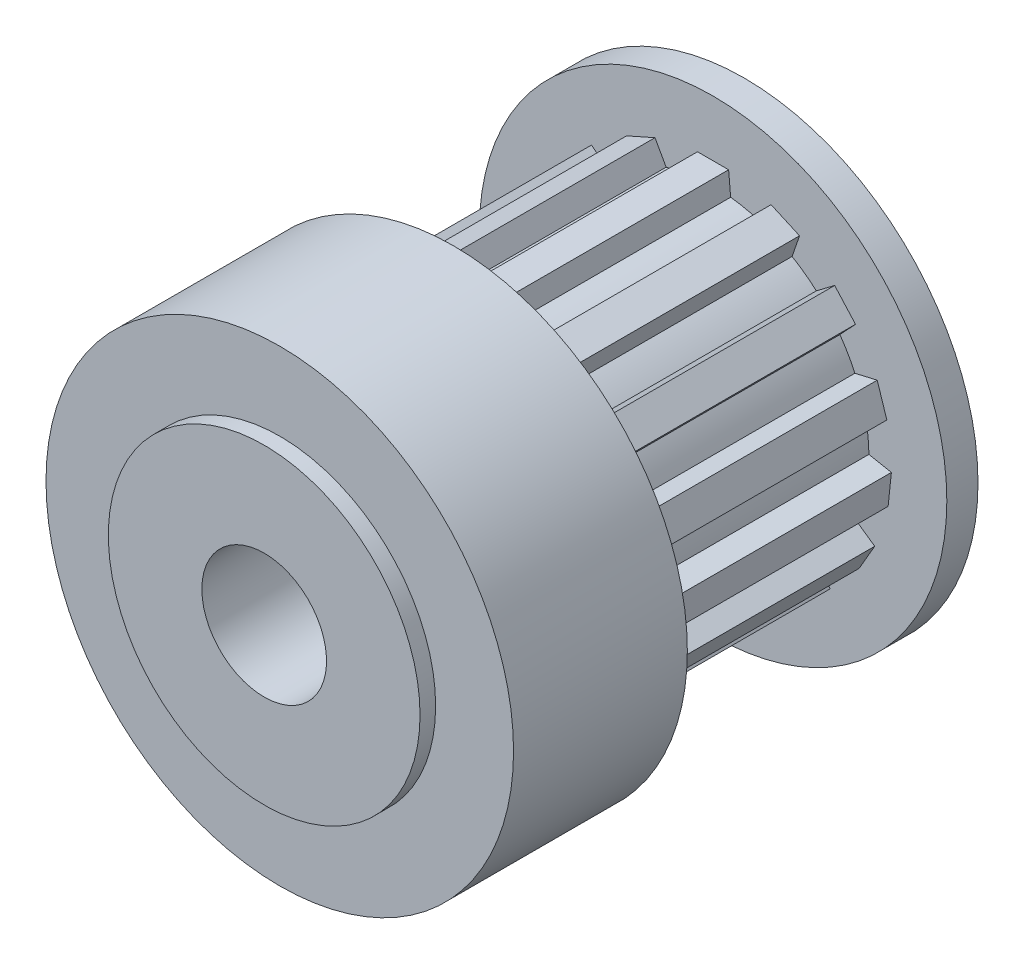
ISO-10303-21;
HEADER;
FILE_DESCRIPTION(('STEP AP214'),'2;1');
FILE_NAME('part.step','',(''),(''),'','','');
FILE_SCHEMA(('AUTOMOTIVE_DESIGN { 1 0 10303 214 1 1 1 1 }'));
ENDSEC;
DATA;
#1=APPLICATION_CONTEXT('core data for automotive mechanical design processes');
#2=APPLICATION_PROTOCOL_DEFINITION('international standard','automotive_design',2000,#1);
#3=PRODUCT_CONTEXT('',#1,'mechanical');
#4=PRODUCT('Part','Part','',(#3));
#5=PRODUCT_RELATED_PRODUCT_CATEGORY('part','',(#4));
#6=PRODUCT_DEFINITION_FORMATION('','',#4);
#7=PRODUCT_DEFINITION_CONTEXT('part definition',#1,'design');
#8=PRODUCT_DEFINITION('design','',#6,#7);
#9=PRODUCT_DEFINITION_SHAPE('','',#8);
#10=(LENGTH_UNIT() NAMED_UNIT(*) SI_UNIT(.MILLI.,.METRE.));
#11=(NAMED_UNIT(*) PLANE_ANGLE_UNIT() SI_UNIT($,.RADIAN.));
#12=(NAMED_UNIT(*) SI_UNIT($,.STERADIAN.) SOLID_ANGLE_UNIT());
#13=UNCERTAINTY_MEASURE_WITH_UNIT(LENGTH_MEASURE(1.E-05),#10,'distance_accuracy_value','');
#14=(GEOMETRIC_REPRESENTATION_CONTEXT(3) GLOBAL_UNCERTAINTY_ASSIGNED_CONTEXT((#13)) GLOBAL_UNIT_ASSIGNED_CONTEXT((#10,
#11,#12)) REPRESENTATION_CONTEXT('',''));
#15=CARTESIAN_POINT('',(0.,0.,0.));
#16=DIRECTION('',(0.,0.,1.));
#17=DIRECTION('',(1.,0.,0.));
#18=AXIS2_PLACEMENT_3D('',#15,#16,#17);
#19=CARTESIAN_POINT('',(0.,0.,0.));
#20=DIRECTION('',(0.,0.,1.));
#21=DIRECTION('',(1.,0.,0.));
#22=AXIS2_PLACEMENT_3D('',#19,#20,#21);
#23=PLANE('',#22);
#24=CARTESIAN_POINT('',(0.,0.,0.));
#25=DIRECTION('',(0.,0.,-1.));
#26=DIRECTION('',(-1.,0.,0.));
#27=AXIS2_PLACEMENT_3D('',#24,#25,#26);
#28=CIRCLE('',#27,2.);
#29=CARTESIAN_POINT('',(-2.,0.,0.));
#30=VERTEX_POINT('',#29);
#31=EDGE_CURVE('E1027',#30,#30,#28,.T.);
#32=ORIENTED_EDGE('',*,*,#31,.T.);
#33=EDGE_LOOP('',(#32));
#34=FACE_BOUND('',#33,.T.);
#35=CARTESIAN_POINT('',(0.,0.,0.));
#36=DIRECTION('',(0.,0.,1.));
#37=DIRECTION('',(1.,0.,0.));
#38=AXIS2_PLACEMENT_3D('',#35,#36,#37);
#39=CIRCLE('',#38,5.);
#40=CARTESIAN_POINT('',(5.,0.,0.));
#41=VERTEX_POINT('',#40);
#42=EDGE_CURVE('E657',#41,#41,#39,.T.);
#43=ORIENTED_EDGE('',*,*,#42,.T.);
#44=EDGE_LOOP('',(#43));
#45=FACE_BOUND('',#44,.T.);
#46=ADVANCED_FACE('F33',(#34,#45),#23,.T.);
#47=CARTESIAN_POINT('',(0.,0.,0.));
#48=DIRECTION('',(0.,0.,1.));
#49=DIRECTION('',(1.,0.,0.));
#50=AXIS2_PLACEMENT_3D('',#47,#48,#49);
#51=CYLINDRICAL_SURFACE('',#50,7.5);
#52=CARTESIAN_POINT('',(-7.5,0.,-2.36970000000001));
#53=CARTESIAN_POINT('',(-7.49999898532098,0.0631060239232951,-2.36970259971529));
#54=CARTESIAN_POINT('',(-7.49919518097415,0.126248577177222,-2.37500277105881));
#55=CARTESIAN_POINT('',(-7.49606600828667,0.25076851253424,-2.39605791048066));
#56=CARTESIAN_POINT('',(-7.49373916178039,0.312144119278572,-2.41182303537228));
#57=CARTESIAN_POINT('',(-7.48782536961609,0.431310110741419,-2.45332610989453));
#58=CARTESIAN_POINT('',(-7.48423937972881,0.489103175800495,-2.47905649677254));
#59=CARTESIAN_POINT('',(-7.47620347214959,0.599542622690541,-2.53974116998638));
#60=CARTESIAN_POINT('',(-7.47175367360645,0.652189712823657,-2.57469418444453));
#61=CARTESIAN_POINT('',(-7.46244569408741,0.75126652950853,-2.65312548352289));
#62=CARTESIAN_POINT('',(-7.45758485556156,0.797649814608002,-2.69666212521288));
#63=CARTESIAN_POINT('',(-7.44802342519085,0.882481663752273,-2.79089925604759));
#64=CARTESIAN_POINT('',(-7.44332284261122,0.920929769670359,-2.84160015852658));
#65=CARTESIAN_POINT('',(-7.43458835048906,0.988980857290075,-2.94903891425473));
#66=CARTESIAN_POINT('',(-7.4305578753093,1.01853886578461,-3.00580555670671));
#67=CARTESIAN_POINT('',(-7.42365624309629,1.06768330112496,-3.12356855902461));
#68=CARTESIAN_POINT('',(-7.42078502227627,1.08727027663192,-3.1845646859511));
#69=CARTESIAN_POINT('',(-7.41655312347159,1.1157723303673,-3.30856662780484));
#70=CARTESIAN_POINT('',(-7.41518119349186,1.12476694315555,-3.37155377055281));
#71=CARTESIAN_POINT('',(-7.41406905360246,1.13207534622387,-3.49815716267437));
#72=CARTESIAN_POINT('',(-7.41432874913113,1.1303897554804,-3.56177337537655));
#73=CARTESIAN_POINT('',(-7.41644022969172,1.11645058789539,-3.68726699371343));
#74=CARTESIAN_POINT('',(-7.41827866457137,1.1042856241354,-3.74915449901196));
#75=CARTESIAN_POINT('',(-7.42331962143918,1.06987175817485,-3.86999979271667));
#76=CARTESIAN_POINT('',(-7.42652218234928,1.04762256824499,-3.92895749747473));
#77=CARTESIAN_POINT('',(-7.43394527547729,0.993579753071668,-4.04253903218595));
#78=CARTESIAN_POINT('',(-7.43816979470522,0.961748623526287,-4.0971447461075));
#79=CARTESIAN_POINT('',(-7.44715792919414,0.88947220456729,-4.20027338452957));
#80=CARTESIAN_POINT('',(-7.45192158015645,0.849026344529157,-4.24879590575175));
#81=CARTESIAN_POINT('',(-7.4615102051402,0.760182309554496,-4.33889432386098));
#82=CARTESIAN_POINT('',(-7.4663353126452,0.71170795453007,-4.38039512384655));
#83=CARTESIAN_POINT('',(-7.47545851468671,0.608442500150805,-4.4546839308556));
#84=CARTESIAN_POINT('',(-7.47975660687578,0.553651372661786,-4.48747189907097));
#85=CARTESIAN_POINT('',(-7.48734605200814,0.439242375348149,-4.54340829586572));
#86=CARTESIAN_POINT('',(-7.49063679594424,0.379621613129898,-4.56655089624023));
#87=CARTESIAN_POINT('',(-7.49583568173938,0.257279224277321,-4.60247415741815));
#88=CARTESIAN_POINT('',(-7.49774391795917,0.194557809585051,-4.61525552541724));
#89=CARTESIAN_POINT('',(-7.49995027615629,0.0684426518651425,-4.62999356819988));
#90=CARTESIAN_POINT('',(-7.50026375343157,0.00506123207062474,-4.63205348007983));
#91=CARTESIAN_POINT('',(-7.49928708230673,-0.121141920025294,-4.62556420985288));
#92=CARTESIAN_POINT('',(-7.49799698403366,-0.183963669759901,-4.61701535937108));
#93=CARTESIAN_POINT('',(-7.49396761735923,-0.306951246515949,-4.58963708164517));
#94=CARTESIAN_POINT('',(-7.49123544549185,-0.367128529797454,-4.5708579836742));
#95=CARTESIAN_POINT('',(-7.48462728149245,-0.483480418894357,-4.52360537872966));
#96=CARTESIAN_POINT('',(-7.48075123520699,-0.539654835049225,-4.49513141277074));
#97=CARTESIAN_POINT('',(-7.47224787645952,-0.646860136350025,-4.42905537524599));
#98=CARTESIAN_POINT('',(-7.46761526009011,-0.697850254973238,-4.39138785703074));
#99=CARTESIAN_POINT('',(-7.45813080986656,-0.79282216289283,-4.30808503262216));
#100=CARTESIAN_POINT('',(-7.45327896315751,-0.836803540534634,-4.26244925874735));
#101=CARTESIAN_POINT('',(-7.44385415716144,-0.916885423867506,-4.16404562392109));
#102=CARTESIAN_POINT('',(-7.43928387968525,-0.952916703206,-4.11122112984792));
#103=CARTESIAN_POINT('',(-7.43098728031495,-1.01559431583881,-4.00020890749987));
#104=CARTESIAN_POINT('',(-7.4272609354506,-1.04224090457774,-3.94202132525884));
#105=CARTESIAN_POINT('',(-7.42109355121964,-1.08528559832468,-3.82214056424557));
#106=CARTESIAN_POINT('',(-7.41864795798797,-1.10172005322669,-3.76046068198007));
#107=CARTESIAN_POINT('',(-7.41530689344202,-1.12398960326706,-3.6351766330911));
#108=CARTESIAN_POINT('',(-7.41441131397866,-1.12982543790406,-3.57157260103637));
#109=CARTESIAN_POINT('',(-7.4142757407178,-1.13071437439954,-3.44493579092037));
#110=CARTESIAN_POINT('',(-7.41501903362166,-1.12587632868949,-3.38190376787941));
#111=CARTESIAN_POINT('',(-7.41804111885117,-1.10578818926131,-3.25756074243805));
#112=CARTESIAN_POINT('',(-7.42031990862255,-1.09053811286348,-3.19624973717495));
#113=CARTESIAN_POINT('',(-7.4261503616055,-1.050097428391,-3.07711979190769));
#114=CARTESIAN_POINT('',(-7.42970104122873,-1.02491450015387,-3.01929819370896));
#115=CARTESIAN_POINT('',(-7.43767638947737,-0.965333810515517,-2.9086831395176));
#116=CARTESIAN_POINT('',(-7.44210108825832,-0.930935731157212,-2.85588985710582));
#117=CARTESIAN_POINT('',(-7.45137962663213,-0.853505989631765,-2.75627712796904));
#118=CARTESIAN_POINT('',(-7.45623721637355,-0.810393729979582,-2.7095206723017));
#119=CARTESIAN_POINT('',(-7.46580295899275,-0.716929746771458,-2.62386738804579));
#120=CARTESIAN_POINT('',(-7.4705110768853,-0.66657634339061,-2.58497238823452));
#121=CARTESIAN_POINT('',(-7.47927731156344,-0.559729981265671,-2.51595275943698));
#122=CARTESIAN_POINT('',(-7.48333166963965,-0.503204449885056,-2.4858780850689));
#123=CARTESIAN_POINT('',(-7.49029672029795,-0.385869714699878,-2.43569474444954));
#124=CARTESIAN_POINT('',(-7.49320859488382,-0.325065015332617,-2.41557577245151));
#125=CARTESIAN_POINT('',(-7.49689709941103,-0.219990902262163,-2.39043113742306));
#126=CARTESIAN_POINT('',(-7.49805470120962,-0.176369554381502,-2.38266886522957));
#127=CARTESIAN_POINT('',(-7.49960650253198,-0.0885047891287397,-2.37230241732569));
#128=CARTESIAN_POINT('',(-7.5000007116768,-0.044261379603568,-2.36969817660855));
#129=CARTESIAN_POINT('',(-7.5,0.,-2.36970000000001));
#130=B_SPLINE_CURVE_WITH_KNOTS('',3,(#52,#53,#54,#55,#56,#57,#58,#59,#60,#61,#62,#63,#64,#65,
#66,#67,#68,#69,#70,#71,#72,#73,#74,#75,#76,#77,#78,#79,#80,#81,#82,#83,#84,#85,#86,#87,#88,#89,
#90,#91,#92,#93,#94,#95,#96,#97,#98,#99,#100,#101,#102,#103,#104,#105,#106,#107,#108,#109,#110,
#111,#112,#113,#114,#115,#116,#117,#118,#119,#120,#121,#122,#123,#124,#125,#126,#127,#128,#129),
.UNSPECIFIED.,.T.,.F.,(4,2,2,2,2,2,2,2,2,2,2,2,2,2,2,2,2,2,2,2,2,2,2,2,2,2,2,2,2,2,2,2,2,2,2,2,
2,2,4),(0.,0.189156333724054,0.378496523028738,0.567693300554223,0.756863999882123,
0.947368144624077,1.13788328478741,1.3293465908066,1.52079936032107,1.71080521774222,
1.90080006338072,2.0892039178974,2.27761314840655,2.46676963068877,2.65593864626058,
2.84701793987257,3.0380980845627,3.22929352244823,3.42047590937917,3.60981394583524,
3.79914606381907,3.98755503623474,4.17597292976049,4.36577338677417,4.55558498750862,
4.74698932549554,4.93838845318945,5.12910233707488,5.31980291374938,5.50856772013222,
5.69733221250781,5.88595104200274,6.07457638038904,6.26503347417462,6.45553482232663,
6.6470951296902,6.83845672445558,6.97112909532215,7.10379979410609),.UNSPECIFIED.);
#131=CARTESIAN_POINT('',(-7.5,0.,-2.36970000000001));
#132=VERTEX_POINT('',#131);
#133=EDGE_CURVE('E428',#132,#132,#130,.T.);
#134=ORIENTED_EDGE('',*,*,#133,.F.);
#135=EDGE_LOOP('',(#134));
#136=FACE_BOUND('',#135,.T.);
#137=CARTESIAN_POINT('',(0.,0.,-6.07513466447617));
#138=DIRECTION('',(0.,0.,-1.));
#139=DIRECTION('',(-1.,0.,0.));
#140=AXIS2_PLACEMENT_3D('',#137,#138,#139);
#141=CIRCLE('',#140,7.5);
#142=CARTESIAN_POINT('',(-7.5,0.,-6.07513466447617));
#143=VERTEX_POINT('',#142);
#144=EDGE_CURVE('E46',#143,#143,#141,.F.);
#145=ORIENTED_EDGE('',*,*,#144,.T.);
#146=EDGE_LOOP('',(#145));
#147=FACE_BOUND('',#146,.T.);
#148=CARTESIAN_POINT('',(0.,0.,-0.5));
#149=DIRECTION('',(0.,0.,1.));
#150=DIRECTION('',(1.,0.,0.));
#151=AXIS2_PLACEMENT_3D('',#148,#149,#150);
#152=CIRCLE('',#151,7.5);
#153=CARTESIAN_POINT('',(7.5,0.,-0.5));
#154=VERTEX_POINT('',#153);
#155=EDGE_CURVE('E432',#154,#154,#152,.F.);
#156=ORIENTED_EDGE('',*,*,#155,.T.);
#157=EDGE_LOOP('',(#156));
#158=FACE_BOUND('',#157,.T.);
#159=ADVANCED_FACE('F639',(#136,#147,#158),#51,.T.);
#160=CARTESIAN_POINT('',(5.,0.,-6.3));
#161=DIRECTION('',(0.,0.,-1.));
#162=DIRECTION('',(-1.,0.,0.));
#163=AXIS2_PLACEMENT_3D('',#160,#161,#162);
#164=PLANE('',#163);
#165=CARTESIAN_POINT('',(0.,0.,-6.3));
#166=DIRECTION('',(0.,0.,-1.));
#167=DIRECTION('',(-1.,0.,0.));
#168=AXIS2_PLACEMENT_3D('',#165,#166,#167);
#169=CIRCLE('',#168,5.89999999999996);
#170=CARTESIAN_POINT('',(-5.89999999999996,0.,-6.3));
#171=VERTEX_POINT('',#170);
#172=EDGE_CURVE('E12',#171,#171,#169,.T.);
#173=ORIENTED_EDGE('',*,*,#172,.T.);
#174=EDGE_LOOP('',(#173));
#175=FACE_BOUND('',#174,.T.);
#176=DIRECTION('',(0.913545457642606,-0.406736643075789,0.));
#177=VECTOR('',#176,1.);
#178=CARTESIAN_POINT('',(2.7751715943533,5.00384078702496,-6.3));
#179=LINE('',#178,#177);
#180=CARTESIAN_POINT('',(1.86162613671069,5.41057743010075,-6.3));
#181=VERTEX_POINT('',#180);
#182=CARTESIAN_POINT('',(2.7751715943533,5.00384078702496,-6.3));
#183=VERTEX_POINT('',#182);
#184=EDGE_CURVE('E674',#181,#183,#179,.T.);
#185=ORIENTED_EDGE('',*,*,#184,.F.);
#186=DIRECTION('',(0.484809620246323,0.874619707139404,0.));
#187=VECTOR('',#186,1.);
#188=CARTESIAN_POINT('',(1.86162613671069,5.41057743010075,-6.3));
#189=LINE('',#188,#187);
#190=CARTESIAN_POINT('',(1.50543111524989,4.76798460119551,-6.3));
#191=VERTEX_POINT('',#190);
#192=EDGE_CURVE('E671',#191,#181,#189,.T.);
#193=ORIENTED_EDGE('',*,*,#192,.F.);
#194=CARTESIAN_POINT('',(0.,0.,-6.3));
#195=DIRECTION('',(0.,0.,1.));
#196=DIRECTION('',(1.,0.,0.));
#197=AXIS2_PLACEMENT_3D('',#194,#195,#196);
#198=CIRCLE('',#197,5.);
#199=CARTESIAN_POINT('',(0.564034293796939,4.96808467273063,-6.3));
#200=VERTEX_POINT('',#199);
#201=EDGE_CURVE('E1039',#191,#200,#198,.T.);
#202=ORIENTED_EDGE('',*,*,#201,.T.);
#203=DIRECTION('',(0.0871557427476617,-0.996194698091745,0.));
#204=VECTOR('',#203,1.);
#205=CARTESIAN_POINT('',(0.5,5.7,-6.3));
#206=LINE('',#205,#204);
#207=CARTESIAN_POINT('',(0.5,5.7,-6.3));
#208=VERTEX_POINT('',#207);
#209=EDGE_CURVE('E977',#208,#200,#206,.T.);
#210=ORIENTED_EDGE('',*,*,#209,.F.);
#211=DIRECTION('',(1.,0.,0.));
#212=VECTOR('',#211,1.);
#213=CARTESIAN_POINT('',(0.5,5.7,-6.3));
#214=LINE('',#213,#212);
#215=CARTESIAN_POINT('',(-0.5,5.7,-6.3));
#216=VERTEX_POINT('',#215);
#217=EDGE_CURVE('E1007',#216,#208,#214,.T.);
#218=ORIENTED_EDGE('',*,*,#217,.F.);
#219=DIRECTION('',(0.0871557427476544,0.996194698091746,0.));
#220=VECTOR('',#219,1.);
#221=CARTESIAN_POINT('',(-0.5,5.7,-6.3));
#222=LINE('',#221,#220);
#223=CARTESIAN_POINT('',(-0.564034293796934,4.96808467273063,-6.3));
#224=VERTEX_POINT('',#223);
#225=EDGE_CURVE('E1004',#224,#216,#222,.T.);
#226=ORIENTED_EDGE('',*,*,#225,.F.);
#227=CARTESIAN_POINT('',(-1.50543111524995,4.76798460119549,-6.3));
#228=VERTEX_POINT('',#227);
#229=EDGE_CURVE('E1041',#224,#228,#198,.T.);
#230=ORIENTED_EDGE('',*,*,#229,.T.);
#231=DIRECTION('',(0.484809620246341,-0.874619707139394,0.));
#232=VECTOR('',#231,1.);
#233=CARTESIAN_POINT('',(-1.86162613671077,5.41057743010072,-6.3));
#234=LINE('',#233,#232);
#235=CARTESIAN_POINT('',(-1.86162613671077,5.41057743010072,-6.3));
#236=VERTEX_POINT('',#235);
#237=EDGE_CURVE('E953',#236,#228,#234,.T.);
#238=ORIENTED_EDGE('',*,*,#237,.F.);
#239=DIRECTION('',(0.913545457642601,0.406736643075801,0.));
#240=VECTOR('',#239,1.);
#241=CARTESIAN_POINT('',(-1.86162613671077,5.41057743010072,-6.3));
#242=LINE('',#241,#240);
#243=CARTESIAN_POINT('',(-2.77517159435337,5.00384078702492,-6.3));
#244=VERTEX_POINT('',#243);
#245=EDGE_CURVE('E982',#244,#236,#242,.T.);
#246=ORIENTED_EDGE('',*,*,#245,.F.);
#247=DIRECTION('',(-0.325568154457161,0.945518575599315,0.));
#248=VECTOR('',#247,1.);
#249=CARTESIAN_POINT('',(-2.77517159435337,5.00384078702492,-6.3));
#250=LINE('',#249,#248);
#251=CARTESIAN_POINT('',(-2.53597304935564,4.3091577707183,-6.3));
#252=VERTEX_POINT('',#251);
#253=EDGE_CURVE('E979',#252,#244,#250,.T.);
#254=ORIENTED_EDGE('',*,*,#253,.F.);
#255=CARTESIAN_POINT('',(-3.31459380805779,3.74345667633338,-6.3));
#256=VERTEX_POINT('',#255);
#257=EDGE_CURVE('E1044',#252,#256,#198,.T.);
#258=ORIENTED_EDGE('',*,*,#257,.T.);
#259=DIRECTION('',(0.798635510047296,-0.601815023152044,0.));
#260=VECTOR('',#259,1.);
#261=CARTESIAN_POINT('',(-3.90136020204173,4.18561686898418,-6.3));
#262=LINE('',#261,#260);
#263=CARTESIAN_POINT('',(-3.90136020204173,4.18561686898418,-6.3));
#264=VERTEX_POINT('',#263);
#265=EDGE_CURVE('E929',#264,#256,#262,.T.);
#266=ORIENTED_EDGE('',*,*,#265,.F.);
#267=DIRECTION('',(0.669130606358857,0.743144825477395,0.));
#268=VECTOR('',#267,1.);
#269=CARTESIAN_POINT('',(-3.90136020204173,4.18561686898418,-6.3));
#270=LINE('',#269,#268);
#271=CARTESIAN_POINT('',(-4.57049080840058,3.44247204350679,-6.3));
#272=VERTEX_POINT('',#271);
#273=EDGE_CURVE('E958',#272,#264,#270,.T.);
#274=ORIENTED_EDGE('',*,*,#273,.F.);
#275=DIRECTION('',(-0.681998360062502,0.731353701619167,0.));
#276=VECTOR('',#275,1.);
#277=CARTESIAN_POINT('',(-4.57049080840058,3.44247204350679,-6.3));
#278=LINE('',#277,#276);
#279=CARTESIAN_POINT('',(-4.06941902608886,2.9051383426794,-6.3));
#280=VERTEX_POINT('',#279);
#281=EDGE_CURVE('E955',#280,#272,#278,.T.);
#282=ORIENTED_EDGE('',*,*,#281,.F.);
#283=CARTESIAN_POINT('',(-4.55063311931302,2.07165108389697,-6.3));
#284=VERTEX_POINT('',#283);
#285=EDGE_CURVE('E1155',#280,#284,#198,.T.);
#286=ORIENTED_EDGE('',*,*,#285,.T.);
#287=DIRECTION('',(0.974370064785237,-0.224951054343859,0.));
#288=VECTOR('',#287,1.);
#289=CARTESIAN_POINT('',(-5.26651364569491,2.23692512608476,-6.3));
#290=LINE('',#289,#288);
#291=CARTESIAN_POINT('',(-5.26651364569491,2.23692512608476,-6.3));
#292=VERTEX_POINT('',#291);
#293=EDGE_CURVE('E905',#292,#284,#290,.T.);
#294=ORIENTED_EDGE('',*,*,#293,.F.);
#295=DIRECTION('',(0.309016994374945,0.951056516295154,0.));
#296=VECTOR('',#295,1.);
#297=CARTESIAN_POINT('',(-5.26651364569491,2.23692512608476,-6.3));
#298=LINE('',#297,#296);
#299=CARTESIAN_POINT('',(-5.57553064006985,1.28586860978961,-6.3));
#300=VERTEX_POINT('',#299);
#301=EDGE_CURVE('E934',#300,#292,#298,.T.);
#302=ORIENTED_EDGE('',*,*,#301,.F.);
#303=DIRECTION('',(-0.920504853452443,0.390731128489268,0.));
#304=VECTOR('',#303,1.);
#305=CARTESIAN_POINT('',(-5.57553064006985,1.28586860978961,-6.3));
#306=LINE('',#305,#304);
#307=CARTESIAN_POINT('',(-4.89922548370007,0.998794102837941,-6.3));
#308=VERTEX_POINT('',#307);
#309=EDGE_CURVE('E931',#308,#300,#306,.T.);
#310=ORIENTED_EDGE('',*,*,#309,.F.);
#311=CARTESIAN_POINT('',(-4.99982662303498,0.0416381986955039,-6.3));
#312=VERTEX_POINT('',#311);
#313=EDGE_CURVE('E1157',#308,#312,#198,.T.);
#314=ORIENTED_EDGE('',*,*,#313,.T.);
#315=DIRECTION('',(0.981627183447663,0.190808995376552,0.));
#316=VECTOR('',#315,1.);
#317=CARTESIAN_POINT('',(-5.72103903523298,-0.0985512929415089,-6.3));
#318=LINE('',#317,#316);
#319=CARTESIAN_POINT('',(-5.72103903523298,-0.0985512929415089,-6.3));
#320=VERTEX_POINT('',#319);
#321=EDGE_CURVE('E881',#320,#312,#318,.T.);
#322=ORIENTED_EDGE('',*,*,#321,.F.);
#323=DIRECTION('',(-0.104528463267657,0.994521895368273,0.));
#324=VECTOR('',#323,1.);
#325=CARTESIAN_POINT('',(-5.72103903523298,-0.0985512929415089,-6.3));
#326=LINE('',#325,#324);
#327=CARTESIAN_POINT('',(-5.61651057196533,-1.09307318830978,-6.3));
#328=VERTEX_POINT('',#327);
#329=EDGE_CURVE('E910',#328,#320,#326,.T.);
#330=ORIENTED_EDGE('',*,*,#329,.F.);
#331=DIRECTION('',(-0.999847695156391,-0.0174524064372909,0.));
#332=VECTOR('',#331,1.);
#333=CARTESIAN_POINT('',(-5.61651057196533,-1.09307318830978,-6.3));
#334=LINE('',#333,#332);
#335=CARTESIAN_POINT('',(-4.88191134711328,-1.08025071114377,-6.3));
#336=VERTEX_POINT('',#335);
#337=EDGE_CURVE('E907',#336,#328,#334,.T.);
#338=ORIENTED_EDGE('',*,*,#337,.F.);
#339=CARTESIAN_POINT('',(-4.58450468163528,-1.99557430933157,-6.3));
#340=VERTEX_POINT('',#339);
#341=EDGE_CURVE('E1161',#336,#340,#198,.T.);
#342=ORIENTED_EDGE('',*,*,#341,.T.);
#343=DIRECTION('',(0.819152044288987,0.573576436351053,0.));
#344=VECTOR('',#343,1.);
#345=CARTESIAN_POINT('',(-5.18634480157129,-2.41698729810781,-6.3));
#346=LINE('',#345,#344);
#347=CARTESIAN_POINT('',(-5.18634480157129,-2.41698729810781,-6.3));
#348=VERTEX_POINT('',#347);
#349=EDGE_CURVE('E857',#348,#340,#346,.T.);
#350=ORIENTED_EDGE('',*,*,#349,.F.);
#351=DIRECTION('',(-0.500000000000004,0.866025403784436,0.));
#352=VECTOR('',#351,1.);
#353=CARTESIAN_POINT('',(-5.18634480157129,-2.41698729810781,-6.3));
#354=LINE('',#353,#352);
#355=CARTESIAN_POINT('',(-4.68634480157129,-3.28301270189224,-6.3));
#356=VERTEX_POINT('',#355);
#357=EDGE_CURVE('E886',#356,#348,#354,.T.);
#358=ORIENTED_EDGE('',*,*,#357,.F.);
#359=DIRECTION('',(-0.906307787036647,-0.422618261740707,0.));
#360=VECTOR('',#359,1.);
#361=CARTESIAN_POINT('',(-4.68634480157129,-3.28301270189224,-6.3));
#362=LINE('',#361,#360);
#363=CARTESIAN_POINT('',(-4.02047038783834,-2.97251036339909,-6.3));
#364=VERTEX_POINT('',#363);
#365=EDGE_CURVE('E883',#364,#356,#362,.T.);
#366=ORIENTED_EDGE('',*,*,#365,.F.);
#367=CARTESIAN_POINT('',(-3.37648023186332,-3.68773389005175,-6.3));
#368=VERTEX_POINT('',#367);
#369=EDGE_CURVE('E1166',#364,#368,#198,.T.);
#370=ORIENTED_EDGE('',*,*,#369,.T.);
#371=DIRECTION('',(0.515038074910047,0.857167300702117,0.));
#372=VECTOR('',#371,1.);
#373=CARTESIAN_POINT('',(-3.75488443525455,-4.31750424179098,-6.3));
#374=LINE('',#373,#372);
#375=CARTESIAN_POINT('',(-3.75488443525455,-4.31750424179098,-6.3));
#376=VERTEX_POINT('',#375);
#377=EDGE_CURVE('E833',#376,#368,#374,.T.);
#378=ORIENTED_EDGE('',*,*,#377,.F.);
#379=DIRECTION('',(-0.80901699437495,0.587785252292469,0.));
#380=VECTOR('',#379,1.);
#381=CARTESIAN_POINT('',(-3.75488443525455,-4.31750424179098,-6.3));
#382=LINE('',#381,#380);
#383=CARTESIAN_POINT('',(-2.9458674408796,-4.90528949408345,-6.3));
#384=VERTEX_POINT('',#383);
#385=EDGE_CURVE('E862',#384,#376,#382,.T.);
#386=ORIENTED_EDGE('',*,*,#385,.F.);
#387=DIRECTION('',(-0.6560590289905,-0.754709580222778,0.));
#388=VECTOR('',#387,1.);
#389=CARTESIAN_POINT('',(-2.9458674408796,-4.90528949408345,-6.3));
#390=LINE('',#389,#388);
#391=CARTESIAN_POINT('',(-2.46385357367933,-4.35079596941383,-6.3));
#392=VERTEX_POINT('',#391);
#393=EDGE_CURVE('E859',#392,#384,#390,.T.);
#394=ORIENTED_EDGE('',*,*,#393,.F.);
#395=CARTESIAN_POINT('',(-1.58463167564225,-4.74225077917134,-6.3));
#396=VERTEX_POINT('',#395);
#397=EDGE_CURVE('E1171',#392,#396,#198,.T.);
#398=ORIENTED_EDGE('',*,*,#397,.T.);
#399=DIRECTION('',(0.121869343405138,0.992546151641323,0.));
#400=VECTOR('',#399,1.);
#401=CARTESIAN_POINT('',(-1.6741704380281,-5.47148547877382,-6.3));
#402=LINE('',#401,#400);
#403=CARTESIAN_POINT('',(-1.6741704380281,-5.47148547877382,-6.3));
#404=VERTEX_POINT('',#403);
#405=EDGE_CURVE('E809',#404,#396,#402,.T.);
#406=ORIENTED_EDGE('',*,*,#405,.F.);
#407=DIRECTION('',(-0.978147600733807,0.207911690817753,0.));
#408=VECTOR('',#407,1.);
#409=CARTESIAN_POINT('',(-1.6741704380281,-5.47148547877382,-6.3));
#410=LINE('',#409,#408);
#411=CARTESIAN_POINT('',(-0.69602283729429,-5.67939716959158,-6.3));
#412=VERTEX_POINT('',#411);
#413=EDGE_CURVE('E838',#412,#404,#410,.T.);
#414=ORIENTED_EDGE('',*,*,#413,.F.);
#415=DIRECTION('',(-0.292371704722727,-0.956304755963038,0.));
#416=VECTOR('',#415,1.);
#417=CARTESIAN_POINT('',(-0.69602283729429,-5.67939716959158,-6.3));
#418=LINE('',#417,#416);
#419=CARTESIAN_POINT('',(-0.481214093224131,-4.97678942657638,-6.3));
#420=VERTEX_POINT('',#419);
#421=EDGE_CURVE('E835',#420,#412,#418,.T.);
#422=ORIENTED_EDGE('',*,*,#421,.F.);
#423=CARTESIAN_POINT('',(0.481214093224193,-4.97678942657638,-6.3));
#424=VERTEX_POINT('',#423);
#425=EDGE_CURVE('E1176',#420,#424,#198,.T.);
#426=ORIENTED_EDGE('',*,*,#425,.T.);
#427=DIRECTION('',(-0.292371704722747,0.956304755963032,0.));
#428=VECTOR('',#427,1.);
#429=CARTESIAN_POINT('',(0.696022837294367,-5.67939716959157,-6.3));
#430=LINE('',#429,#428);
#431=CARTESIAN_POINT('',(0.696022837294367,-5.67939716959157,-6.3));
#432=VERTEX_POINT('',#431);
#433=EDGE_CURVE('E785',#432,#424,#430,.T.);
#434=ORIENTED_EDGE('',*,*,#433,.F.);
#435=DIRECTION('',(-0.978147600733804,-0.207911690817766,0.));
#436=VECTOR('',#435,1.);
#437=CARTESIAN_POINT('',(0.696022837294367,-5.67939716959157,-6.3));
#438=LINE('',#437,#436);
#439=CARTESIAN_POINT('',(1.67417043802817,-5.4714854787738,-6.3));
#440=VERTEX_POINT('',#439);
#441=EDGE_CURVE('E814',#440,#432,#438,.T.);
#442=ORIENTED_EDGE('',*,*,#441,.F.);
#443=DIRECTION('',(0.121869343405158,-0.992546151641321,0.));
#444=VECTOR('',#443,1.);
#445=CARTESIAN_POINT('',(1.67417043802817,-5.4714854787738,-6.3));
#446=LINE('',#445,#444);
#447=CARTESIAN_POINT('',(1.58463167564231,-4.74225077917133,-6.3));
#448=VERTEX_POINT('',#447);
#449=EDGE_CURVE('E811',#448,#440,#446,.T.);
#450=ORIENTED_EDGE('',*,*,#449,.F.);
#451=CARTESIAN_POINT('',(2.46385357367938,-4.3507959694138,-6.3));
#452=VERTEX_POINT('',#451);
#453=EDGE_CURVE('E1181',#448,#452,#198,.T.);
#454=ORIENTED_EDGE('',*,*,#453,.T.);
#455=DIRECTION('',(-0.656059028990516,0.754709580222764,0.));
#456=VECTOR('',#455,1.);
#457=CARTESIAN_POINT('',(2.94586744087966,-4.90528949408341,-6.3));
#458=LINE('',#457,#456);
#459=CARTESIAN_POINT('',(2.94586744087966,-4.90528949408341,-6.3));
#460=VERTEX_POINT('',#459);
#461=EDGE_CURVE('E761',#460,#452,#458,.T.);
#462=ORIENTED_EDGE('',*,*,#461,.F.);
#463=DIRECTION('',(-0.809016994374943,-0.58778525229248,0.));
#464=VECTOR('',#463,1.);
#465=CARTESIAN_POINT('',(2.94586744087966,-4.90528949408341,-6.3));
#466=LINE('',#465,#464);
#467=CARTESIAN_POINT('',(3.75488443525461,-4.31750424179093,-6.3));
#468=VERTEX_POINT('',#467);
#469=EDGE_CURVE('E790',#468,#460,#466,.T.);
#470=ORIENTED_EDGE('',*,*,#469,.F.);
#471=DIRECTION('',(0.515038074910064,-0.857167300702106,0.));
#472=VECTOR('',#471,1.);
#473=CARTESIAN_POINT('',(3.75488443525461,-4.31750424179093,-6.3));
#474=LINE('',#473,#472);
#475=CARTESIAN_POINT('',(3.37648023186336,-3.68773389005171,-6.3));
#476=VERTEX_POINT('',#475);
#477=EDGE_CURVE('E787',#476,#468,#474,.T.);
#478=ORIENTED_EDGE('',*,*,#477,.F.);
#479=CARTESIAN_POINT('',(4.02047038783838,-2.97251036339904,-6.3));
#480=VERTEX_POINT('',#479);
#481=EDGE_CURVE('E1186',#476,#480,#198,.T.);
#482=ORIENTED_EDGE('',*,*,#481,.T.);
#483=DIRECTION('',(-0.906307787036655,0.422618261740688,0.));
#484=VECTOR('',#483,1.);
#485=CARTESIAN_POINT('',(4.68634480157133,-3.28301270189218,-6.3));
#486=LINE('',#485,#484);
#487=CARTESIAN_POINT('',(4.68634480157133,-3.28301270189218,-6.3));
#488=VERTEX_POINT('',#487);
#489=EDGE_CURVE('E737',#488,#480,#486,.T.);
#490=ORIENTED_EDGE('',*,*,#489,.F.);
#491=DIRECTION('',(-0.499999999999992,-0.866025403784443,0.));
#492=VECTOR('',#491,1.);
#493=CARTESIAN_POINT('',(4.68634480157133,-3.28301270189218,-6.3));
#494=LINE('',#493,#492);
#495=CARTESIAN_POINT('',(5.18634480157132,-2.41698729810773,-6.3));
#496=VERTEX_POINT('',#495);
#497=EDGE_CURVE('E766',#496,#488,#494,.T.);
#498=ORIENTED_EDGE('',*,*,#497,.F.);
#499=DIRECTION('',(0.819152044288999,-0.573576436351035,0.));
#500=VECTOR('',#499,1.);
#501=CARTESIAN_POINT('',(5.18634480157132,-2.41698729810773,-6.3));
#502=LINE('',#501,#500);
#503=CARTESIAN_POINT('',(4.58450468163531,-1.99557430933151,-6.3));
#504=VERTEX_POINT('',#503);
#505=EDGE_CURVE('E763',#504,#496,#502,.T.);
#506=ORIENTED_EDGE('',*,*,#505,.F.);
#507=CARTESIAN_POINT('',(4.88191134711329,-1.0802507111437,-6.3));
#508=VERTEX_POINT('',#507);
#509=EDGE_CURVE('E1191',#504,#508,#198,.T.);
#510=ORIENTED_EDGE('',*,*,#509,.T.);
#511=DIRECTION('',(-0.999847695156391,0.0174524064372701,0.));
#512=VECTOR('',#511,1.);
#513=CARTESIAN_POINT('',(5.61651057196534,-1.09307318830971,-6.3));
#514=LINE('',#513,#512);
#515=CARTESIAN_POINT('',(5.61651057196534,-1.09307318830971,-6.3));
#516=VERTEX_POINT('',#515);
#517=EDGE_CURVE('E713',#516,#508,#514,.T.);
#518=ORIENTED_EDGE('',*,*,#517,.F.);
#519=DIRECTION('',(-0.104528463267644,-0.994521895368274,0.));
#520=VECTOR('',#519,1.);
#521=CARTESIAN_POINT('',(5.61651057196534,-1.09307318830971,-6.3));
#522=LINE('',#521,#520);
#523=CARTESIAN_POINT('',(5.72103903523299,-0.0985512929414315,-6.3));
#524=VERTEX_POINT('',#523);
#525=EDGE_CURVE('E742',#524,#516,#522,.T.);
#526=ORIENTED_EDGE('',*,*,#525,.F.);
#527=DIRECTION('',(0.981627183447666,-0.190808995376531,0.));
#528=VECTOR('',#527,1.);
#529=CARTESIAN_POINT('',(5.72103903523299,-0.0985512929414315,-6.3));
#530=LINE('',#529,#528);
#531=CARTESIAN_POINT('',(4.99982662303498,0.041638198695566,-6.3));
#532=VERTEX_POINT('',#531);
#533=EDGE_CURVE('E739',#532,#524,#530,.T.);
#534=ORIENTED_EDGE('',*,*,#533,.F.);
#535=CARTESIAN_POINT('',(4.89922548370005,0.998794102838,-6.3));
#536=VERTEX_POINT('',#535);
#537=EDGE_CURVE('E1196',#532,#536,#198,.T.);
#538=ORIENTED_EDGE('',*,*,#537,.T.);
#539=DIRECTION('',(-0.920504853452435,-0.390731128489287,0.));
#540=VECTOR('',#539,1.);
#541=CARTESIAN_POINT('',(5.57553064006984,1.28586860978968,-6.3));
#542=LINE('',#541,#540);
#543=CARTESIAN_POINT('',(5.57553064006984,1.28586860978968,-6.3));
#544=VERTEX_POINT('',#543);
#545=EDGE_CURVE('E691',#544,#536,#542,.T.);
#546=ORIENTED_EDGE('',*,*,#545,.F.);
#547=DIRECTION('',(0.309016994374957,-0.95105651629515,0.));
#548=VECTOR('',#547,1.);
#549=CARTESIAN_POINT('',(5.57553064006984,1.28586860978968,-6.3));
#550=LINE('',#549,#548);
#551=CARTESIAN_POINT('',(5.26651364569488,2.23692512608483,-6.3));
#552=VERTEX_POINT('',#551);
#553=EDGE_CURVE('E718',#552,#544,#550,.T.);
#554=ORIENTED_EDGE('',*,*,#553,.F.);
#555=DIRECTION('',(0.974370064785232,0.224951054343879,0.));
#556=VECTOR('',#555,1.);
#557=CARTESIAN_POINT('',(5.26651364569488,2.23692512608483,-6.3));
#558=LINE('',#557,#556);
#559=CARTESIAN_POINT('',(4.55063311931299,2.07165108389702,-6.3));
#560=VERTEX_POINT('',#559);
#561=EDGE_CURVE('E715',#560,#552,#558,.T.);
#562=ORIENTED_EDGE('',*,*,#561,.F.);
#563=CARTESIAN_POINT('',(4.06941902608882,2.90513834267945,-6.3));
#564=VERTEX_POINT('',#563);
#565=EDGE_CURVE('E1201',#560,#564,#198,.T.);
#566=ORIENTED_EDGE('',*,*,#565,.T.);
#567=DIRECTION('',(-0.681998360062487,-0.731353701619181,0.));
#568=VECTOR('',#567,1.);
#569=CARTESIAN_POINT('',(4.57049080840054,3.44247204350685,-6.3));
#570=LINE('',#569,#568);
#571=CARTESIAN_POINT('',(4.57049080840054,3.44247204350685,-6.3));
#572=VERTEX_POINT('',#571);
#573=EDGE_CURVE('E668',#572,#564,#570,.T.);
#574=ORIENTED_EDGE('',*,*,#573,.F.);
#575=DIRECTION('',(0.669130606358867,-0.743144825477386,0.));
#576=VECTOR('',#575,1.);
#577=CARTESIAN_POINT('',(4.57049080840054,3.44247204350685,-6.3));
#578=LINE('',#577,#576);
#579=CARTESIAN_POINT('',(3.90136020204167,4.18561686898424,-6.3));
#580=VERTEX_POINT('',#579);
#581=EDGE_CURVE('E696',#580,#572,#578,.T.);
#582=ORIENTED_EDGE('',*,*,#581,.F.);
#583=DIRECTION('',(0.798635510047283,0.601815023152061,0.));
#584=VECTOR('',#583,1.);
#585=CARTESIAN_POINT('',(3.90136020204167,4.18561686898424,-6.3));
#586=LINE('',#585,#584);
#587=CARTESIAN_POINT('',(3.31459380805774,3.74345667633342,-6.3));
#588=VERTEX_POINT('',#587);
#589=EDGE_CURVE('E693',#588,#580,#586,.T.);
#590=ORIENTED_EDGE('',*,*,#589,.F.);
#591=CARTESIAN_POINT('',(2.53597304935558,4.30915777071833,-6.3));
#592=VERTEX_POINT('',#591);
#593=EDGE_CURVE('E1206',#588,#592,#198,.T.);
#594=ORIENTED_EDGE('',*,*,#593,.T.);
#595=DIRECTION('',(-0.325568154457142,-0.945518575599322,0.));
#596=VECTOR('',#595,1.);
#597=CARTESIAN_POINT('',(2.7751715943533,5.00384078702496,-6.3));
#598=LINE('',#597,#596);
#599=EDGE_CURVE('E669',#183,#592,#598,.T.);
#600=ORIENTED_EDGE('',*,*,#599,.F.);
#601=EDGE_LOOP('',(#185,#193,#202,#210,#218,#226,#230,#238,#246,#254,#258,#266,#274,#282,#286,
#294,#302,#310,#314,#322,#330,#338,#342,#350,#358,#366,#370,#378,#386,#394,#398,#406,#414,#422,
#426,#434,#442,#450,#454,#462,#470,#478,#482,#490,#498,#506,#510,#518,#526,#534,#538,#546,#554,
#562,#566,#574,#582,#590,#594,#600));
#602=FACE_BOUND('',#601,.T.);
#603=ADVANCED_FACE('F644',(#175,#602),#164,.T.);
#604=CARTESIAN_POINT('',(0.,0.,0.));
#605=DIRECTION('',(0.,0.,1.));
#606=DIRECTION('',(1.,0.,0.));
#607=AXIS2_PLACEMENT_3D('',#604,#605,#606);
#608=CYLINDRICAL_SURFACE('',#607,5.);
#609=ORIENTED_EDGE('',*,*,#201,.F.);
#610=DIRECTION('',(0.,0.,1.));
#611=VECTOR('',#610,1.);
#612=CARTESIAN_POINT('',(1.50543111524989,4.76798460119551,-16.0808825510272));
#613=LINE('',#612,#611);
#614=CARTESIAN_POINT('',(1.50543111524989,4.76798460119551,-14.4));
#615=VERTEX_POINT('',#614);
#616=EDGE_CURVE('E681',#615,#191,#613,.T.);
#617=ORIENTED_EDGE('',*,*,#616,.F.);
#618=CARTESIAN_POINT('',(0.,0.,-14.4));
#619=DIRECTION('',(0.,0.,1.));
#620=DIRECTION('',(1.,0.,0.));
#621=AXIS2_PLACEMENT_3D('',#618,#619,#620);
#622=CIRCLE('',#621,5.);
#623=CARTESIAN_POINT('',(0.564034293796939,4.96808467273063,-14.4));
#624=VERTEX_POINT('',#623);
#625=EDGE_CURVE('E1035',#615,#624,#622,.T.);
#626=ORIENTED_EDGE('',*,*,#625,.T.);
#627=DIRECTION('',(0.,0.,1.));
#628=VECTOR('',#627,1.);
#629=CARTESIAN_POINT('',(0.564034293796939,4.96808467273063,-15.7447076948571));
#630=LINE('',#629,#628);
#631=EDGE_CURVE('E1016',#624,#200,#630,.T.);
#632=ORIENTED_EDGE('',*,*,#631,.T.);
#633=EDGE_LOOP('',(#609,#617,#626,#632));
#634=FACE_BOUND('',#633,.T.);
#635=ADVANCED_FACE('F1060',(#634),#608,.T.);
#636=CARTESIAN_POINT('',(3.31459380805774,3.74345667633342,-14.4));
#637=VERTEX_POINT('',#636);
#638=CARTESIAN_POINT('',(2.53597304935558,4.30915777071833,-14.4));
#639=VERTEX_POINT('',#638);
#640=EDGE_CURVE('E1077',#637,#639,#622,.T.);
#641=ORIENTED_EDGE('',*,*,#640,.T.);
#642=DIRECTION('',(0.,0.,1.));
#643=VECTOR('',#642,1.);
#644=CARTESIAN_POINT('',(2.53597304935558,4.30915777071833,-16.0808825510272));
#645=LINE('',#644,#643);
#646=EDGE_CURVE('E54',#639,#592,#645,.T.);
#647=ORIENTED_EDGE('',*,*,#646,.T.);
#648=ORIENTED_EDGE('',*,*,#593,.F.);
#649=DIRECTION('',(0.,0.,1.));
#650=VECTOR('',#649,1.);
#651=CARTESIAN_POINT('',(3.31459380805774,3.74345667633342,-16.1935725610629));
#652=LINE('',#651,#650);
#653=EDGE_CURVE('E703',#637,#588,#652,.T.);
#654=ORIENTED_EDGE('',*,*,#653,.F.);
#655=EDGE_LOOP('',(#641,#647,#648,#654));
#656=FACE_BOUND('',#655,.T.);
#657=ADVANCED_FACE('F1236',(#656),#608,.T.);
#658=CARTESIAN_POINT('',(5.,0.,-14.4));
#659=DIRECTION('',(0.,0.,1.));
#660=DIRECTION('',(1.,0.,0.));
#661=AXIS2_PLACEMENT_3D('',#658,#659,#660);
#662=PLANE('',#661);
#663=CARTESIAN_POINT('',(0.,0.,-14.4));
#664=DIRECTION('',(0.,0.,1.));
#665=DIRECTION('',(1.,0.,0.));
#666=AXIS2_PLACEMENT_3D('',#663,#664,#665);
#667=CIRCLE('',#666,7.5);
#668=CARTESIAN_POINT('',(7.5,0.,-14.4));
#669=VERTEX_POINT('',#668);
#670=EDGE_CURVE('E1029',#669,#669,#667,.T.);
#671=ORIENTED_EDGE('',*,*,#670,.T.);
#672=EDGE_LOOP('',(#671));
#673=FACE_BOUND('',#672,.T.);
#674=ORIENTED_EDGE('',*,*,#625,.F.);
#675=DIRECTION('',(-0.484809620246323,-0.874619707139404,0.));
#676=VECTOR('',#675,1.);
#677=CARTESIAN_POINT('',(1.86162613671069,5.41057743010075,-14.4));
#678=LINE('',#677,#676);
#679=CARTESIAN_POINT('',(1.86162613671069,5.41057743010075,-14.4));
#680=VERTEX_POINT('',#679);
#681=EDGE_CURVE('E663',#680,#615,#678,.T.);
#682=ORIENTED_EDGE('',*,*,#681,.F.);
#683=DIRECTION('',(-0.913545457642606,0.406736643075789,0.));
#684=VECTOR('',#683,1.);
#685=CARTESIAN_POINT('',(2.7751715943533,5.00384078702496,-14.4));
#686=LINE('',#685,#684);
#687=CARTESIAN_POINT('',(2.7751715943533,5.00384078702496,-14.4));
#688=VERTEX_POINT('',#687);
#689=EDGE_CURVE('E666',#688,#680,#686,.T.);
#690=ORIENTED_EDGE('',*,*,#689,.F.);
#691=DIRECTION('',(0.325568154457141,0.945518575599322,0.));
#692=VECTOR('',#691,1.);
#693=CARTESIAN_POINT('',(2.7751715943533,5.00384078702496,-14.4));
#694=LINE('',#693,#692);
#695=EDGE_CURVE('E665',#639,#688,#694,.T.);
#696=ORIENTED_EDGE('',*,*,#695,.F.);
#697=ORIENTED_EDGE('',*,*,#640,.F.);
#698=DIRECTION('',(-0.798635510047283,-0.601815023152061,0.));
#699=VECTOR('',#698,1.);
#700=CARTESIAN_POINT('',(3.90136020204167,4.18561686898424,-14.4));
#701=LINE('',#700,#699);
#702=CARTESIAN_POINT('',(3.90136020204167,4.18561686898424,-14.4));
#703=VERTEX_POINT('',#702);
#704=EDGE_CURVE('E686',#703,#637,#701,.T.);
#705=ORIENTED_EDGE('',*,*,#704,.F.);
#706=DIRECTION('',(-0.669130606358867,0.743144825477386,0.));
#707=VECTOR('',#706,1.);
#708=CARTESIAN_POINT('',(4.57049080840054,3.44247204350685,-14.4));
#709=LINE('',#708,#707);
#710=CARTESIAN_POINT('',(4.57049080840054,3.44247204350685,-14.4));
#711=VERTEX_POINT('',#710);
#712=EDGE_CURVE('E689',#711,#703,#709,.T.);
#713=ORIENTED_EDGE('',*,*,#712,.F.);
#714=DIRECTION('',(0.681998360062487,0.731353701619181,0.));
#715=VECTOR('',#714,1.);
#716=CARTESIAN_POINT('',(4.57049080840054,3.44247204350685,-14.4));
#717=LINE('',#716,#715);
#718=CARTESIAN_POINT('',(4.06941902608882,2.90513834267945,-14.4));
#719=VERTEX_POINT('',#718);
#720=EDGE_CURVE('E688',#719,#711,#717,.T.);
#721=ORIENTED_EDGE('',*,*,#720,.F.);
#722=CARTESIAN_POINT('',(4.55063311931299,2.07165108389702,-14.4));
#723=VERTEX_POINT('',#722);
#724=EDGE_CURVE('E1079',#723,#719,#622,.T.);
#725=ORIENTED_EDGE('',*,*,#724,.F.);
#726=DIRECTION('',(-0.974370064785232,-0.224951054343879,0.));
#727=VECTOR('',#726,1.);
#728=CARTESIAN_POINT('',(5.26651364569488,2.23692512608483,-14.4));
#729=LINE('',#728,#727);
#730=CARTESIAN_POINT('',(5.26651364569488,2.23692512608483,-14.4));
#731=VERTEX_POINT('',#730);
#732=EDGE_CURVE('E708',#731,#723,#729,.T.);
#733=ORIENTED_EDGE('',*,*,#732,.F.);
#734=DIRECTION('',(-0.309016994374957,0.95105651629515,0.));
#735=VECTOR('',#734,1.);
#736=CARTESIAN_POINT('',(5.57553064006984,1.28586860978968,-14.4));
#737=LINE('',#736,#735);
#738=CARTESIAN_POINT('',(5.57553064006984,1.28586860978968,-14.4));
#739=VERTEX_POINT('',#738);
#740=EDGE_CURVE('E711',#739,#731,#737,.T.);
#741=ORIENTED_EDGE('',*,*,#740,.F.);
#742=DIRECTION('',(0.920504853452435,0.390731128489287,0.));
#743=VECTOR('',#742,1.);
#744=CARTESIAN_POINT('',(5.57553064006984,1.28586860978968,-14.4));
#745=LINE('',#744,#743);
#746=CARTESIAN_POINT('',(4.89922548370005,0.998794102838,-14.4));
#747=VERTEX_POINT('',#746);
#748=EDGE_CURVE('E710',#747,#739,#745,.T.);
#749=ORIENTED_EDGE('',*,*,#748,.F.);
#750=CARTESIAN_POINT('',(4.99982662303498,0.041638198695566,-14.4));
#751=VERTEX_POINT('',#750);
#752=EDGE_CURVE('E1084',#751,#747,#622,.T.);
#753=ORIENTED_EDGE('',*,*,#752,.F.);
#754=DIRECTION('',(-0.981627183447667,0.190808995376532,0.));
#755=VECTOR('',#754,1.);
#756=CARTESIAN_POINT('',(5.72103903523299,-0.0985512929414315,-14.4));
#757=LINE('',#756,#755);
#758=CARTESIAN_POINT('',(5.72103903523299,-0.0985512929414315,-14.4));
#759=VERTEX_POINT('',#758);
#760=EDGE_CURVE('E732',#759,#751,#757,.T.);
#761=ORIENTED_EDGE('',*,*,#760,.F.);
#762=DIRECTION('',(0.104528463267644,0.994521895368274,0.));
#763=VECTOR('',#762,1.);
#764=CARTESIAN_POINT('',(5.61651057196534,-1.09307318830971,-14.4));
#765=LINE('',#764,#763);
#766=CARTESIAN_POINT('',(5.61651057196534,-1.09307318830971,-14.4));
#767=VERTEX_POINT('',#766);
#768=EDGE_CURVE('E735',#767,#759,#765,.T.);
#769=ORIENTED_EDGE('',*,*,#768,.F.);
#770=DIRECTION('',(0.999847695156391,-0.0174524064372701,0.));
#771=VECTOR('',#770,1.);
#772=CARTESIAN_POINT('',(5.61651057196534,-1.09307318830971,-14.4));
#773=LINE('',#772,#771);
#774=CARTESIAN_POINT('',(4.88191134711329,-1.08025071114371,-14.4));
#775=VERTEX_POINT('',#774);
#776=EDGE_CURVE('E734',#775,#767,#773,.T.);
#777=ORIENTED_EDGE('',*,*,#776,.F.);
#778=CARTESIAN_POINT('',(4.58450468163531,-1.99557430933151,-14.4));
#779=VERTEX_POINT('',#778);
#780=EDGE_CURVE('E1089',#779,#775,#622,.T.);
#781=ORIENTED_EDGE('',*,*,#780,.F.);
#782=DIRECTION('',(-0.819152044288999,0.573576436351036,0.));
#783=VECTOR('',#782,1.);
#784=CARTESIAN_POINT('',(5.18634480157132,-2.41698729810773,-14.4));
#785=LINE('',#784,#783);
#786=CARTESIAN_POINT('',(5.18634480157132,-2.41698729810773,-14.4));
#787=VERTEX_POINT('',#786);
#788=EDGE_CURVE('E756',#787,#779,#785,.T.);
#789=ORIENTED_EDGE('',*,*,#788,.F.);
#790=DIRECTION('',(0.499999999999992,0.866025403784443,0.));
#791=VECTOR('',#790,1.);
#792=CARTESIAN_POINT('',(4.68634480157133,-3.28301270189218,-14.4));
#793=LINE('',#792,#791);
#794=CARTESIAN_POINT('',(4.68634480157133,-3.28301270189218,-14.4));
#795=VERTEX_POINT('',#794);
#796=EDGE_CURVE('E759',#795,#787,#793,.T.);
#797=ORIENTED_EDGE('',*,*,#796,.F.);
#798=DIRECTION('',(0.906307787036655,-0.422618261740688,0.));
#799=VECTOR('',#798,1.);
#800=CARTESIAN_POINT('',(4.68634480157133,-3.28301270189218,-14.4));
#801=LINE('',#800,#799);
#802=CARTESIAN_POINT('',(4.02047038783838,-2.97251036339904,-14.4));
#803=VERTEX_POINT('',#802);
#804=EDGE_CURVE('E758',#803,#795,#801,.T.);
#805=ORIENTED_EDGE('',*,*,#804,.F.);
#806=CARTESIAN_POINT('',(3.37648023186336,-3.68773389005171,-14.4));
#807=VERTEX_POINT('',#806);
#808=EDGE_CURVE('E1094',#807,#803,#622,.T.);
#809=ORIENTED_EDGE('',*,*,#808,.F.);
#810=DIRECTION('',(-0.515038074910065,0.857167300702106,0.));
#811=VECTOR('',#810,1.);
#812=CARTESIAN_POINT('',(3.75488443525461,-4.31750424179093,-14.4));
#813=LINE('',#812,#811);
#814=CARTESIAN_POINT('',(3.75488443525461,-4.31750424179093,-14.4));
#815=VERTEX_POINT('',#814);
#816=EDGE_CURVE('E780',#815,#807,#813,.T.);
#817=ORIENTED_EDGE('',*,*,#816,.F.);
#818=DIRECTION('',(0.809016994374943,0.58778525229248,0.));
#819=VECTOR('',#818,1.);
#820=CARTESIAN_POINT('',(2.94586744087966,-4.90528949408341,-14.4));
#821=LINE('',#820,#819);
#822=CARTESIAN_POINT('',(2.94586744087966,-4.90528949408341,-14.4));
#823=VERTEX_POINT('',#822);
#824=EDGE_CURVE('E783',#823,#815,#821,.T.);
#825=ORIENTED_EDGE('',*,*,#824,.F.);
#826=DIRECTION('',(0.656059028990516,-0.754709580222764,0.));
#827=VECTOR('',#826,1.);
#828=CARTESIAN_POINT('',(2.94586744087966,-4.90528949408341,-14.4));
#829=LINE('',#828,#827);
#830=CARTESIAN_POINT('',(2.46385357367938,-4.3507959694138,-14.4));
#831=VERTEX_POINT('',#830);
#832=EDGE_CURVE('E782',#831,#823,#829,.T.);
#833=ORIENTED_EDGE('',*,*,#832,.F.);
#834=CARTESIAN_POINT('',(1.58463167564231,-4.74225077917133,-14.4));
#835=VERTEX_POINT('',#834);
#836=EDGE_CURVE('E1099',#835,#831,#622,.T.);
#837=ORIENTED_EDGE('',*,*,#836,.F.);
#838=DIRECTION('',(-0.121869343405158,0.992546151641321,0.));
#839=VECTOR('',#838,1.);
#840=CARTESIAN_POINT('',(1.67417043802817,-5.4714854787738,-14.4));
#841=LINE('',#840,#839);
#842=CARTESIAN_POINT('',(1.67417043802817,-5.4714854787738,-14.4));
#843=VERTEX_POINT('',#842);
#844=EDGE_CURVE('E804',#843,#835,#841,.T.);
#845=ORIENTED_EDGE('',*,*,#844,.F.);
#846=DIRECTION('',(0.978147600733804,0.207911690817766,0.));
#847=VECTOR('',#846,1.);
#848=CARTESIAN_POINT('',(0.696022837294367,-5.67939716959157,-14.4));
#849=LINE('',#848,#847);
#850=CARTESIAN_POINT('',(0.696022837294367,-5.67939716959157,-14.4));
#851=VERTEX_POINT('',#850);
#852=EDGE_CURVE('E807',#851,#843,#849,.T.);
#853=ORIENTED_EDGE('',*,*,#852,.F.);
#854=DIRECTION('',(0.292371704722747,-0.956304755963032,0.));
#855=VECTOR('',#854,1.);
#856=CARTESIAN_POINT('',(0.696022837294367,-5.67939716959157,-14.4));
#857=LINE('',#856,#855);
#858=CARTESIAN_POINT('',(0.481214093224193,-4.97678942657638,-14.4));
#859=VERTEX_POINT('',#858);
#860=EDGE_CURVE('E806',#859,#851,#857,.T.);
#861=ORIENTED_EDGE('',*,*,#860,.F.);
#862=CARTESIAN_POINT('',(-0.481214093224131,-4.97678942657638,-14.4));
#863=VERTEX_POINT('',#862);
#864=EDGE_CURVE('E1104',#863,#859,#622,.T.);
#865=ORIENTED_EDGE('',*,*,#864,.F.);
#866=DIRECTION('',(0.292371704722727,0.956304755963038,0.));
#867=VECTOR('',#866,1.);
#868=CARTESIAN_POINT('',(-0.69602283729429,-5.67939716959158,-14.4));
#869=LINE('',#868,#867);
#870=CARTESIAN_POINT('',(-0.69602283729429,-5.67939716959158,-14.4));
#871=VERTEX_POINT('',#870);
#872=EDGE_CURVE('E828',#871,#863,#869,.T.);
#873=ORIENTED_EDGE('',*,*,#872,.F.);
#874=DIRECTION('',(0.978147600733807,-0.207911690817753,0.));
#875=VECTOR('',#874,1.);
#876=CARTESIAN_POINT('',(-1.6741704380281,-5.47148547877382,-14.4));
#877=LINE('',#876,#875);
#878=CARTESIAN_POINT('',(-1.6741704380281,-5.47148547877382,-14.4));
#879=VERTEX_POINT('',#878);
#880=EDGE_CURVE('E831',#879,#871,#877,.T.);
#881=ORIENTED_EDGE('',*,*,#880,.F.);
#882=DIRECTION('',(-0.121869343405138,-0.992546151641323,0.));
#883=VECTOR('',#882,1.);
#884=CARTESIAN_POINT('',(-1.6741704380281,-5.47148547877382,-14.4));
#885=LINE('',#884,#883);
#886=CARTESIAN_POINT('',(-1.58463167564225,-4.74225077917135,-14.4));
#887=VERTEX_POINT('',#886);
#888=EDGE_CURVE('E830',#887,#879,#885,.T.);
#889=ORIENTED_EDGE('',*,*,#888,.F.);
#890=CARTESIAN_POINT('',(-2.46385357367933,-4.35079596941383,-14.4));
#891=VERTEX_POINT('',#890);
#892=EDGE_CURVE('E1109',#891,#887,#622,.T.);
#893=ORIENTED_EDGE('',*,*,#892,.F.);
#894=DIRECTION('',(0.656059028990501,0.754709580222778,0.));
#895=VECTOR('',#894,1.);
#896=CARTESIAN_POINT('',(-2.9458674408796,-4.90528949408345,-14.4));
#897=LINE('',#896,#895);
#898=CARTESIAN_POINT('',(-2.9458674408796,-4.90528949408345,-14.4));
#899=VERTEX_POINT('',#898);
#900=EDGE_CURVE('E852',#899,#891,#897,.T.);
#901=ORIENTED_EDGE('',*,*,#900,.F.);
#902=DIRECTION('',(0.809016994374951,-0.587785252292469,0.));
#903=VECTOR('',#902,1.);
#904=CARTESIAN_POINT('',(-3.75488443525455,-4.31750424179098,-14.4));
#905=LINE('',#904,#903);
#906=CARTESIAN_POINT('',(-3.75488443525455,-4.31750424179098,-14.4));
#907=VERTEX_POINT('',#906);
#908=EDGE_CURVE('E855',#907,#899,#905,.T.);
#909=ORIENTED_EDGE('',*,*,#908,.F.);
#910=DIRECTION('',(-0.515038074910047,-0.857167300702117,0.));
#911=VECTOR('',#910,1.);
#912=CARTESIAN_POINT('',(-3.75488443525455,-4.31750424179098,-14.4));
#913=LINE('',#912,#911);
#914=CARTESIAN_POINT('',(-3.37648023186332,-3.68773389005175,-14.4));
#915=VERTEX_POINT('',#914);
#916=EDGE_CURVE('E854',#915,#907,#913,.T.);
#917=ORIENTED_EDGE('',*,*,#916,.F.);
#918=CARTESIAN_POINT('',(-4.02047038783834,-2.97251036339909,-14.4));
#919=VERTEX_POINT('',#918);
#920=EDGE_CURVE('E1114',#919,#915,#622,.T.);
#921=ORIENTED_EDGE('',*,*,#920,.F.);
#922=DIRECTION('',(0.906307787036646,0.422618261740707,0.));
#923=VECTOR('',#922,1.);
#924=CARTESIAN_POINT('',(-4.68634480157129,-3.28301270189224,-14.4));
#925=LINE('',#924,#923);
#926=CARTESIAN_POINT('',(-4.68634480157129,-3.28301270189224,-14.4));
#927=VERTEX_POINT('',#926);
#928=EDGE_CURVE('E876',#927,#919,#925,.T.);
#929=ORIENTED_EDGE('',*,*,#928,.F.);
#930=DIRECTION('',(0.500000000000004,-0.866025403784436,0.));
#931=VECTOR('',#930,1.);
#932=CARTESIAN_POINT('',(-5.18634480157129,-2.41698729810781,-14.4));
#933=LINE('',#932,#931);
#934=CARTESIAN_POINT('',(-5.18634480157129,-2.41698729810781,-14.4));
#935=VERTEX_POINT('',#934);
#936=EDGE_CURVE('E879',#935,#927,#933,.T.);
#937=ORIENTED_EDGE('',*,*,#936,.F.);
#938=DIRECTION('',(-0.819152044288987,-0.573576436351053,0.));
#939=VECTOR('',#938,1.);
#940=CARTESIAN_POINT('',(-5.18634480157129,-2.41698729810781,-14.4));
#941=LINE('',#940,#939);
#942=CARTESIAN_POINT('',(-4.58450468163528,-1.99557430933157,-14.4));
#943=VERTEX_POINT('',#942);
#944=EDGE_CURVE('E878',#943,#935,#941,.T.);
#945=ORIENTED_EDGE('',*,*,#944,.F.);
#946=CARTESIAN_POINT('',(-4.88191134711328,-1.08025071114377,-14.4));
#947=VERTEX_POINT('',#946);
#948=EDGE_CURVE('E1119',#947,#943,#622,.T.);
#949=ORIENTED_EDGE('',*,*,#948,.F.);
#950=DIRECTION('',(0.999847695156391,0.0174524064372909,0.));
#951=VECTOR('',#950,1.);
#952=CARTESIAN_POINT('',(-5.61651057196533,-1.09307318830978,-14.4));
#953=LINE('',#952,#951);
#954=CARTESIAN_POINT('',(-5.61651057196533,-1.09307318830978,-14.4));
#955=VERTEX_POINT('',#954);
#956=EDGE_CURVE('E900',#955,#947,#953,.T.);
#957=ORIENTED_EDGE('',*,*,#956,.F.);
#958=DIRECTION('',(0.104528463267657,-0.994521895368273,0.));
#959=VECTOR('',#958,1.);
#960=CARTESIAN_POINT('',(-5.72103903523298,-0.0985512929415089,-14.4));
#961=LINE('',#960,#959);
#962=CARTESIAN_POINT('',(-5.72103903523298,-0.0985512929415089,-14.4));
#963=VERTEX_POINT('',#962);
#964=EDGE_CURVE('E903',#963,#955,#961,.T.);
#965=ORIENTED_EDGE('',*,*,#964,.F.);
#966=DIRECTION('',(-0.981627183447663,-0.190808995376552,0.));
#967=VECTOR('',#966,1.);
#968=CARTESIAN_POINT('',(-5.72103903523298,-0.0985512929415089,-14.4));
#969=LINE('',#968,#967);
#970=CARTESIAN_POINT('',(-4.99982662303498,0.0416381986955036,-14.4));
#971=VERTEX_POINT('',#970);
#972=EDGE_CURVE('E902',#971,#963,#969,.T.);
#973=ORIENTED_EDGE('',*,*,#972,.F.);
#974=CARTESIAN_POINT('',(-4.89922548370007,0.998794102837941,-14.4));
#975=VERTEX_POINT('',#974);
#976=EDGE_CURVE('E1124',#975,#971,#622,.T.);
#977=ORIENTED_EDGE('',*,*,#976,.F.);
#978=DIRECTION('',(0.920504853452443,-0.390731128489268,0.));
#979=VECTOR('',#978,1.);
#980=CARTESIAN_POINT('',(-5.57553064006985,1.28586860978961,-14.4));
#981=LINE('',#980,#979);
#982=CARTESIAN_POINT('',(-5.57553064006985,1.28586860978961,-14.4));
#983=VERTEX_POINT('',#982);
#984=EDGE_CURVE('E924',#983,#975,#981,.T.);
#985=ORIENTED_EDGE('',*,*,#984,.F.);
#986=DIRECTION('',(-0.309016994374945,-0.951056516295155,0.));
#987=VECTOR('',#986,1.);
#988=CARTESIAN_POINT('',(-5.26651364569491,2.23692512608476,-14.4));
#989=LINE('',#988,#987);
#990=CARTESIAN_POINT('',(-5.26651364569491,2.23692512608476,-14.4));
#991=VERTEX_POINT('',#990);
#992=EDGE_CURVE('E927',#991,#983,#989,.T.);
#993=ORIENTED_EDGE('',*,*,#992,.F.);
#994=DIRECTION('',(-0.974370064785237,0.224951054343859,0.));
#995=VECTOR('',#994,1.);
#996=CARTESIAN_POINT('',(-5.26651364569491,2.23692512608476,-14.4));
#997=LINE('',#996,#995);
#998=CARTESIAN_POINT('',(-4.55063311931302,2.07165108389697,-14.4));
#999=VERTEX_POINT('',#998);
#1000=EDGE_CURVE('E926',#999,#991,#997,.T.);
#1001=ORIENTED_EDGE('',*,*,#1000,.F.);
#1002=CARTESIAN_POINT('',(-4.06941902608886,2.9051383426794,-14.4));
#1003=VERTEX_POINT('',#1002);
#1004=EDGE_CURVE('E1129',#1003,#999,#622,.T.);
#1005=ORIENTED_EDGE('',*,*,#1004,.F.);
#1006=DIRECTION('',(0.681998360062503,-0.731353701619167,0.));
#1007=VECTOR('',#1006,1.);
#1008=CARTESIAN_POINT('',(-4.57049080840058,3.44247204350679,-14.4));
#1009=LINE('',#1008,#1007);
#1010=CARTESIAN_POINT('',(-4.57049080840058,3.44247204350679,-14.4));
#1011=VERTEX_POINT('',#1010);
#1012=EDGE_CURVE('E948',#1011,#1003,#1009,.T.);
#1013=ORIENTED_EDGE('',*,*,#1012,.F.);
#1014=DIRECTION('',(-0.669130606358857,-0.743144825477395,0.));
#1015=VECTOR('',#1014,1.);
#1016=CARTESIAN_POINT('',(-3.90136020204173,4.18561686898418,-14.4));
#1017=LINE('',#1016,#1015);
#1018=CARTESIAN_POINT('',(-3.90136020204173,4.18561686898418,-14.4));
#1019=VERTEX_POINT('',#1018);
#1020=EDGE_CURVE('E951',#1019,#1011,#1017,.T.);
#1021=ORIENTED_EDGE('',*,*,#1020,.F.);
#1022=DIRECTION('',(-0.798635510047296,0.601815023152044,0.));
#1023=VECTOR('',#1022,1.);
#1024=CARTESIAN_POINT('',(-3.90136020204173,4.18561686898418,-14.4));
#1025=LINE('',#1024,#1023);
#1026=CARTESIAN_POINT('',(-3.31459380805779,3.74345667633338,-14.4));
#1027=VERTEX_POINT('',#1026);
#1028=EDGE_CURVE('E950',#1027,#1019,#1025,.T.);
#1029=ORIENTED_EDGE('',*,*,#1028,.F.);
#1030=CARTESIAN_POINT('',(-2.53597304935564,4.3091577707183,-14.4));
#1031=VERTEX_POINT('',#1030);
#1032=EDGE_CURVE('E1040',#1031,#1027,#622,.T.);
#1033=ORIENTED_EDGE('',*,*,#1032,.F.);
#1034=DIRECTION('',(0.325568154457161,-0.945518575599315,0.));
#1035=VECTOR('',#1034,1.);
#1036=CARTESIAN_POINT('',(-2.77517159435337,5.00384078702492,-14.4));
#1037=LINE('',#1036,#1035);
#1038=CARTESIAN_POINT('',(-2.77517159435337,5.00384078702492,-14.4));
#1039=VERTEX_POINT('',#1038);
#1040=EDGE_CURVE('E972',#1039,#1031,#1037,.T.);
#1041=ORIENTED_EDGE('',*,*,#1040,.F.);
#1042=DIRECTION('',(-0.913545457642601,-0.406736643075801,0.));
#1043=VECTOR('',#1042,1.);
#1044=CARTESIAN_POINT('',(-1.86162613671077,5.41057743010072,-14.4));
#1045=LINE('',#1044,#1043);
#1046=CARTESIAN_POINT('',(-1.86162613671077,5.41057743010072,-14.4));
#1047=VERTEX_POINT('',#1046);
#1048=EDGE_CURVE('E975',#1047,#1039,#1045,.T.);
#1049=ORIENTED_EDGE('',*,*,#1048,.F.);
#1050=DIRECTION('',(-0.484809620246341,0.874619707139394,0.));
#1051=VECTOR('',#1050,1.);
#1052=CARTESIAN_POINT('',(-1.86162613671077,5.41057743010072,-14.4));
#1053=LINE('',#1052,#1051);
#1054=CARTESIAN_POINT('',(-1.50543111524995,4.76798460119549,-14.4));
#1055=VERTEX_POINT('',#1054);
#1056=EDGE_CURVE('E974',#1055,#1047,#1053,.T.);
#1057=ORIENTED_EDGE('',*,*,#1056,.F.);
#1058=CARTESIAN_POINT('',(-0.564034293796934,4.96808467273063,-14.4));
#1059=VERTEX_POINT('',#1058);
#1060=EDGE_CURVE('E1036',#1059,#1055,#622,.T.);
#1061=ORIENTED_EDGE('',*,*,#1060,.F.);
#1062=DIRECTION('',(-0.0871557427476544,-0.996194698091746,0.));
#1063=VECTOR('',#1062,1.);
#1064=CARTESIAN_POINT('',(-0.5,5.7,-14.4));
#1065=LINE('',#1064,#1063);
#1066=CARTESIAN_POINT('',(-0.5,5.7,-14.4));
#1067=VERTEX_POINT('',#1066);
#1068=EDGE_CURVE('E996',#1067,#1059,#1065,.T.);
#1069=ORIENTED_EDGE('',*,*,#1068,.F.);
#1070=DIRECTION('',(-1.,0.,0.));
#1071=VECTOR('',#1070,1.);
#1072=CARTESIAN_POINT('',(0.5,5.7,-14.4));
#1073=LINE('',#1072,#1071);
#1074=CARTESIAN_POINT('',(0.5,5.7,-14.4));
#1075=VERTEX_POINT('',#1074);
#1076=EDGE_CURVE('E999',#1075,#1067,#1073,.T.);
#1077=ORIENTED_EDGE('',*,*,#1076,.F.);
#1078=DIRECTION('',(-0.0871557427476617,0.996194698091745,0.));
#1079=VECTOR('',#1078,1.);
#1080=CARTESIAN_POINT('',(0.5,5.7,-14.4));
#1081=LINE('',#1080,#1079);
#1082=EDGE_CURVE('E998',#624,#1075,#1081,.T.);
#1083=ORIENTED_EDGE('',*,*,#1082,.F.);
#1084=EDGE_LOOP('',(#674,#682,#690,#696,#697,#705,#713,#721,#725,#733,#741,#749,#753,#761,#769,
#777,#781,#789,#797,#805,#809,#817,#825,#833,#837,#845,#853,#861,#865,#873,#881,#889,#893,#901,
#909,#917,#921,#929,#937,#945,#949,#957,#965,#973,#977,#985,#993,#1001,#1005,#1013,#1021,#1029,
#1033,#1041,#1049,#1057,#1061,#1069,#1077,#1083));
#1085=FACE_BOUND('',#1084,.T.);
#1086=ADVANCED_FACE('F1075',(#673,#1085),#662,.T.);
#1087=ORIENTED_EDGE('',*,*,#724,.T.);
#1088=DIRECTION('',(0.,0.,1.));
#1089=VECTOR('',#1088,1.);
#1090=CARTESIAN_POINT('',(4.06941902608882,2.90513834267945,-16.1935725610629));
#1091=LINE('',#1090,#1089);
#1092=EDGE_CURVE('E62',#719,#564,#1091,.T.);
#1093=ORIENTED_EDGE('',*,*,#1092,.T.);
#1094=ORIENTED_EDGE('',*,*,#565,.F.);
#1095=DIRECTION('',(0.,0.,1.));
#1096=VECTOR('',#1095,1.);
#1097=CARTESIAN_POINT('',(4.55063311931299,2.07165108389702,-16.0072906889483));
#1098=LINE('',#1097,#1096);
#1099=EDGE_CURVE('E725',#723,#560,#1098,.T.);
#1100=ORIENTED_EDGE('',*,*,#1099,.F.);
#1101=EDGE_LOOP('',(#1087,#1093,#1094,#1100));
#1102=FACE_BOUND('',#1101,.T.);
#1103=ADVANCED_FACE('F1240',(#1102),#608,.T.);
#1104=ORIENTED_EDGE('',*,*,#752,.T.);
#1105=DIRECTION('',(0.,0.,1.));
#1106=VECTOR('',#1105,1.);
#1107=CARTESIAN_POINT('',(4.89922548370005,0.998794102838,-16.0072906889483));
#1108=LINE('',#1107,#1106);
#1109=EDGE_CURVE('E727',#747,#536,#1108,.T.);
#1110=ORIENTED_EDGE('',*,*,#1109,.T.);
#1111=ORIENTED_EDGE('',*,*,#537,.F.);
#1112=DIRECTION('',(0.,0.,1.));
#1113=VECTOR('',#1112,1.);
#1114=CARTESIAN_POINT('',(4.99982662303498,0.041638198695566,-15.8112778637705));
#1115=LINE('',#1114,#1113);
#1116=EDGE_CURVE('E749',#751,#532,#1115,.T.);
#1117=ORIENTED_EDGE('',*,*,#1116,.F.);
#1118=EDGE_LOOP('',(#1104,#1110,#1111,#1117));
#1119=FACE_BOUND('',#1118,.T.);
#1120=ADVANCED_FACE('F1246',(#1119),#608,.T.);
#1121=ORIENTED_EDGE('',*,*,#780,.T.);
#1122=DIRECTION('',(0.,0.,1.));
#1123=VECTOR('',#1122,1.);
#1124=CARTESIAN_POINT('',(4.88191134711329,-1.0802507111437,-15.8112778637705));
#1125=LINE('',#1124,#1123);
#1126=EDGE_CURVE('E751',#775,#508,#1125,.T.);
#1127=ORIENTED_EDGE('',*,*,#1126,.T.);
#1128=ORIENTED_EDGE('',*,*,#509,.F.);
#1129=DIRECTION('',(0.,0.,1.));
#1130=VECTOR('',#1129,1.);
#1131=CARTESIAN_POINT('',(4.58450468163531,-1.99557430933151,-16.136882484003));
#1132=LINE('',#1131,#1130);
#1133=EDGE_CURVE('E773',#779,#504,#1132,.T.);
#1134=ORIENTED_EDGE('',*,*,#1133,.F.);
#1135=EDGE_LOOP('',(#1121,#1127,#1128,#1134));
#1136=FACE_BOUND('',#1135,.T.);
#1137=ADVANCED_FACE('F1250',(#1136),#608,.T.);
#1138=ORIENTED_EDGE('',*,*,#808,.T.);
#1139=DIRECTION('',(0.,0.,1.));
#1140=VECTOR('',#1139,1.);
#1141=CARTESIAN_POINT('',(4.02047038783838,-2.97251036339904,-16.136882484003));
#1142=LINE('',#1141,#1140);
#1143=EDGE_CURVE('E775',#803,#480,#1142,.T.);
#1144=ORIENTED_EDGE('',*,*,#1143,.T.);
#1145=ORIENTED_EDGE('',*,*,#481,.F.);
#1146=DIRECTION('',(0.,0.,1.));
#1147=VECTOR('',#1146,1.);
#1148=CARTESIAN_POINT('',(3.37648023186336,-3.68773389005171,-16.1745992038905));
#1149=LINE('',#1148,#1147);
#1150=EDGE_CURVE('E797',#807,#476,#1149,.T.);
#1151=ORIENTED_EDGE('',*,*,#1150,.F.);
#1152=EDGE_LOOP('',(#1138,#1144,#1145,#1151));
#1153=FACE_BOUND('',#1152,.T.);
#1154=ADVANCED_FACE('F1254',(#1153),#608,.T.);
#1155=ORIENTED_EDGE('',*,*,#836,.T.);
#1156=DIRECTION('',(0.,0.,1.));
#1157=VECTOR('',#1156,1.);
#1158=CARTESIAN_POINT('',(2.46385357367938,-4.3507959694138,-16.1745992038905));
#1159=LINE('',#1158,#1157);
#1160=EDGE_CURVE('E799',#831,#452,#1159,.T.);
#1161=ORIENTED_EDGE('',*,*,#1160,.T.);
#1162=ORIENTED_EDGE('',*,*,#453,.F.);
#1163=DIRECTION('',(0.,0.,1.));
#1164=VECTOR('',#1163,1.);
#1165=CARTESIAN_POINT('',(1.58463167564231,-4.74225077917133,-15.9170326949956));
#1166=LINE('',#1165,#1164);
#1167=EDGE_CURVE('E821',#835,#448,#1166,.T.);
#1168=ORIENTED_EDGE('',*,*,#1167,.F.);
#1169=EDGE_LOOP('',(#1155,#1161,#1162,#1168));
#1170=FACE_BOUND('',#1169,.T.);
#1171=ADVANCED_FACE('F1258',(#1170),#608,.T.);
#1172=ORIENTED_EDGE('',*,*,#864,.T.);
#1173=DIRECTION('',(0.,0.,1.));
#1174=VECTOR('',#1173,1.);
#1175=CARTESIAN_POINT('',(0.481214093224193,-4.97678942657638,-15.9170326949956));
#1176=LINE('',#1175,#1174);
#1177=EDGE_CURVE('E823',#859,#424,#1176,.T.);
#1178=ORIENTED_EDGE('',*,*,#1177,.T.);
#1179=ORIENTED_EDGE('',*,*,#425,.F.);
#1180=DIRECTION('',(0.,0.,1.));
#1181=VECTOR('',#1180,1.);
#1182=CARTESIAN_POINT('',(-0.481214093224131,-4.97678942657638,-15.9170326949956));
#1183=LINE('',#1182,#1181);
#1184=EDGE_CURVE('E845',#863,#420,#1183,.T.);
#1185=ORIENTED_EDGE('',*,*,#1184,.F.);
#1186=EDGE_LOOP('',(#1172,#1178,#1179,#1185));
#1187=FACE_BOUND('',#1186,.T.);
#1188=ADVANCED_FACE('F1262',(#1187),#608,.T.);
#1189=ORIENTED_EDGE('',*,*,#892,.T.);
#1190=DIRECTION('',(0.,0.,1.));
#1191=VECTOR('',#1190,1.);
#1192=CARTESIAN_POINT('',(-1.58463167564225,-4.74225077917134,-15.9170326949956));
#1193=LINE('',#1192,#1191);
#1194=EDGE_CURVE('E847',#887,#396,#1193,.T.);
#1195=ORIENTED_EDGE('',*,*,#1194,.T.);
#1196=ORIENTED_EDGE('',*,*,#397,.F.);
#1197=DIRECTION('',(0.,0.,1.));
#1198=VECTOR('',#1197,1.);
#1199=CARTESIAN_POINT('',(-2.46385357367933,-4.35079596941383,-16.1745992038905));
#1200=LINE('',#1199,#1198);
#1201=EDGE_CURVE('E869',#891,#392,#1200,.T.);
#1202=ORIENTED_EDGE('',*,*,#1201,.F.);
#1203=EDGE_LOOP('',(#1189,#1195,#1196,#1202));
#1204=FACE_BOUND('',#1203,.T.);
#1205=ADVANCED_FACE('F1266',(#1204),#608,.T.);
#1206=ORIENTED_EDGE('',*,*,#920,.T.);
#1207=DIRECTION('',(0.,0.,1.));
#1208=VECTOR('',#1207,1.);
#1209=CARTESIAN_POINT('',(-3.37648023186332,-3.68773389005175,-16.1745992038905));
#1210=LINE('',#1209,#1208);
#1211=EDGE_CURVE('E871',#915,#368,#1210,.T.);
#1212=ORIENTED_EDGE('',*,*,#1211,.T.);
#1213=ORIENTED_EDGE('',*,*,#369,.F.);
#1214=DIRECTION('',(0.,0.,1.));
#1215=VECTOR('',#1214,1.);
#1216=CARTESIAN_POINT('',(-4.02047038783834,-2.97251036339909,-16.136882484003));
#1217=LINE('',#1216,#1215);
#1218=EDGE_CURVE('E893',#919,#364,#1217,.T.);
#1219=ORIENTED_EDGE('',*,*,#1218,.F.);
#1220=EDGE_LOOP('',(#1206,#1212,#1213,#1219));
#1221=FACE_BOUND('',#1220,.T.);
#1222=ADVANCED_FACE('F1270',(#1221),#608,.T.);
#1223=ORIENTED_EDGE('',*,*,#948,.T.);
#1224=DIRECTION('',(0.,0.,1.));
#1225=VECTOR('',#1224,1.);
#1226=CARTESIAN_POINT('',(-4.58450468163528,-1.99557430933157,-16.136882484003));
#1227=LINE('',#1226,#1225);
#1228=EDGE_CURVE('E895',#943,#340,#1227,.T.);
#1229=ORIENTED_EDGE('',*,*,#1228,.T.);
#1230=ORIENTED_EDGE('',*,*,#341,.F.);
#1231=DIRECTION('',(0.,0.,1.));
#1232=VECTOR('',#1231,1.);
#1233=CARTESIAN_POINT('',(-4.88191134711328,-1.08025071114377,-15.8112778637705));
#1234=LINE('',#1233,#1232);
#1235=EDGE_CURVE('E917',#947,#336,#1234,.T.);
#1236=ORIENTED_EDGE('',*,*,#1235,.F.);
#1237=EDGE_LOOP('',(#1223,#1229,#1230,#1236));
#1238=FACE_BOUND('',#1237,.T.);
#1239=ADVANCED_FACE('F1274',(#1238),#608,.T.);
#1240=ORIENTED_EDGE('',*,*,#976,.T.);
#1241=DIRECTION('',(0.,0.,1.));
#1242=VECTOR('',#1241,1.);
#1243=CARTESIAN_POINT('',(-4.99982662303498,0.0416381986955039,-15.8112778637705));
#1244=LINE('',#1243,#1242);
#1245=EDGE_CURVE('E919',#971,#312,#1244,.T.);
#1246=ORIENTED_EDGE('',*,*,#1245,.T.);
#1247=ORIENTED_EDGE('',*,*,#313,.F.);
#1248=DIRECTION('',(0.,0.,1.));
#1249=VECTOR('',#1248,1.);
#1250=CARTESIAN_POINT('',(-4.89922548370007,0.998794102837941,-16.0072906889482));
#1251=LINE('',#1250,#1249);
#1252=EDGE_CURVE('E941',#975,#308,#1251,.T.);
#1253=ORIENTED_EDGE('',*,*,#1252,.F.);
#1254=EDGE_LOOP('',(#1240,#1246,#1247,#1253));
#1255=FACE_BOUND('',#1254,.T.);
#1256=ADVANCED_FACE('F1278',(#1255),#608,.T.);
#1257=ORIENTED_EDGE('',*,*,#1004,.T.);
#1258=DIRECTION('',(0.,0.,1.));
#1259=VECTOR('',#1258,1.);
#1260=CARTESIAN_POINT('',(-4.55063311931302,2.07165108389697,-16.0072906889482));
#1261=LINE('',#1260,#1259);
#1262=EDGE_CURVE('E943',#999,#284,#1261,.T.);
#1263=ORIENTED_EDGE('',*,*,#1262,.T.);
#1264=ORIENTED_EDGE('',*,*,#285,.F.);
#1265=DIRECTION('',(0.,0.,1.));
#1266=VECTOR('',#1265,1.);
#1267=CARTESIAN_POINT('',(-4.06941902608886,2.9051383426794,-16.1935725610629));
#1268=LINE('',#1267,#1266);
#1269=EDGE_CURVE('E965',#1003,#280,#1268,.T.);
#1270=ORIENTED_EDGE('',*,*,#1269,.F.);
#1271=EDGE_LOOP('',(#1257,#1263,#1264,#1270));
#1272=FACE_BOUND('',#1271,.T.);
#1273=ADVANCED_FACE('F1233',(#1272),#608,.T.);
#1274=ORIENTED_EDGE('',*,*,#1032,.T.);
#1275=DIRECTION('',(0.,0.,1.));
#1276=VECTOR('',#1275,1.);
#1277=CARTESIAN_POINT('',(-3.31459380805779,3.74345667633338,-16.1935725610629));
#1278=LINE('',#1277,#1276);
#1279=EDGE_CURVE('E967',#1027,#256,#1278,.T.);
#1280=ORIENTED_EDGE('',*,*,#1279,.T.);
#1281=ORIENTED_EDGE('',*,*,#257,.F.);
#1282=DIRECTION('',(0.,0.,1.));
#1283=VECTOR('',#1282,1.);
#1284=CARTESIAN_POINT('',(-2.53597304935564,4.3091577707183,-16.0808825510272));
#1285=LINE('',#1284,#1283);
#1286=EDGE_CURVE('E989',#1031,#252,#1285,.T.);
#1287=ORIENTED_EDGE('',*,*,#1286,.F.);
#1288=EDGE_LOOP('',(#1274,#1280,#1281,#1287));
#1289=FACE_BOUND('',#1288,.T.);
#1290=ADVANCED_FACE('F1141',(#1289),#608,.T.);
#1291=ORIENTED_EDGE('',*,*,#1060,.T.);
#1292=DIRECTION('',(0.,0.,1.));
#1293=VECTOR('',#1292,1.);
#1294=CARTESIAN_POINT('',(-1.50543111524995,4.76798460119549,-16.0808825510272));
#1295=LINE('',#1294,#1293);
#1296=EDGE_CURVE('E991',#1055,#228,#1295,.T.);
#1297=ORIENTED_EDGE('',*,*,#1296,.T.);
#1298=ORIENTED_EDGE('',*,*,#229,.F.);
#1299=DIRECTION('',(0.,0.,1.));
#1300=VECTOR('',#1299,1.);
#1301=CARTESIAN_POINT('',(-0.564034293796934,4.96808467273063,-15.7447076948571));
#1302=LINE('',#1301,#1300);
#1303=EDGE_CURVE('E1014',#1059,#224,#1302,.T.);
#1304=ORIENTED_EDGE('',*,*,#1303,.F.);
#1305=EDGE_LOOP('',(#1291,#1297,#1298,#1304));
#1306=FACE_BOUND('',#1305,.T.);
#1307=ADVANCED_FACE('F1220',(#1306),#608,.T.);
#1308=CARTESIAN_POINT('',(0.,0.,0.));
#1309=DIRECTION('',(0.,0.,1.));
#1310=DIRECTION('',(1.,0.,0.));
#1311=AXIS2_PLACEMENT_3D('',#1308,#1309,#1310);
#1312=CYLINDRICAL_SURFACE('',#1311,7.5);
#1313=ORIENTED_EDGE('',*,*,#670,.F.);
#1314=EDGE_LOOP('',(#1313));
#1315=FACE_BOUND('',#1314,.T.);
#1316=CARTESIAN_POINT('',(0.,0.,-15.4));
#1317=DIRECTION('',(0.,0.,-1.));
#1318=DIRECTION('',(-1.,0.,0.));
#1319=AXIS2_PLACEMENT_3D('',#1316,#1317,#1318);
#1320=CIRCLE('',#1319,7.5);
#1321=CARTESIAN_POINT('',(-7.5,0.,-15.4));
#1322=VERTEX_POINT('',#1321);
#1323=EDGE_CURVE('E1024',#1322,#1322,#1320,.F.);
#1324=ORIENTED_EDGE('',*,*,#1323,.T.);
#1325=EDGE_LOOP('',(#1324));
#1326=FACE_BOUND('',#1325,.T.);
#1327=ADVANCED_FACE('F1226',(#1315,#1326),#1312,.T.);
#1328=CARTESIAN_POINT('',(7.5,0.,-16.));
#1329=DIRECTION('',(0.,0.,-1.));
#1330=DIRECTION('',(-1.,0.,0.));
#1331=AXIS2_PLACEMENT_3D('',#1328,#1329,#1330);
#1332=PLANE('',#1331);
#1333=CARTESIAN_POINT('',(0.,0.,-16.));
#1334=DIRECTION('',(0.,0.,-1.));
#1335=DIRECTION('',(-1.,0.,0.));
#1336=AXIS2_PLACEMENT_3D('',#1333,#1334,#1335);
#1337=CIRCLE('',#1336,2.);
#1338=CARTESIAN_POINT('',(-2.,0.,-16.));
#1339=VERTEX_POINT('',#1338);
#1340=EDGE_CURVE('E1030',#1339,#1339,#1337,.T.);
#1341=ORIENTED_EDGE('',*,*,#1340,.F.);
#1342=EDGE_LOOP('',(#1341));
#1343=FACE_BOUND('',#1342,.T.);
#1344=CARTESIAN_POINT('',(0.,0.,-16.));
#1345=DIRECTION('',(0.,0.,-1.));
#1346=DIRECTION('',(-1.,0.,0.));
#1347=AXIS2_PLACEMENT_3D('',#1344,#1345,#1346);
#1348=CIRCLE('',#1347,5.);
#1349=CARTESIAN_POINT('',(-5.,0.,-16.));
#1350=VERTEX_POINT('',#1349);
#1351=EDGE_CURVE('E1001',#1350,#1350,#1348,.T.);
#1352=ORIENTED_EDGE('',*,*,#1351,.T.);
#1353=EDGE_LOOP('',(#1352));
#1354=FACE_BOUND('',#1353,.T.);
#1355=ADVANCED_FACE('F634',(#1343,#1354),#1332,.T.);
#1356=CARTESIAN_POINT('',(0.,0.,0.));
#1357=DIRECTION('',(0.,0.,-1.));
#1358=DIRECTION('',(-1.,0.,0.));
#1359=AXIS2_PLACEMENT_3D('',#1356,#1357,#1358);
#1360=CYLINDRICAL_SURFACE('',#1359,2.);
#1361=CARTESIAN_POINT('',(-2.,0.,-2.36970000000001));
#1362=CARTESIAN_POINT('',(-2.00000281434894,0.058521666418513,-2.36969679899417));
#1363=CARTESIAN_POINT('',(-1.99741033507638,0.117025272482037,-2.37426400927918));
#1364=CARTESIAN_POINT('',(-1.98731520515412,0.232205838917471,-2.39227455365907));
#1365=CARTESIAN_POINT('',(-1.979812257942,0.288882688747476,-2.40571842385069));
#1366=CARTESIAN_POINT('',(-1.96065867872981,0.398640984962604,-2.44076733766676));
#1367=CARTESIAN_POINT('',(-1.94902339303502,0.451734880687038,-2.46234220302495));
#1368=CARTESIAN_POINT('',(-1.92261908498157,0.553443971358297,-2.51282994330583));
#1369=CARTESIAN_POINT('',(-1.90784928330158,0.602058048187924,-2.54174464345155));
#1370=CARTESIAN_POINT('',(-1.87522936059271,0.697298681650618,-2.60839035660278));
#1371=CARTESIAN_POINT('',(-1.85723495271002,0.74353871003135,-2.64660175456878));
#1372=CARTESIAN_POINT('',(-1.82054920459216,0.829326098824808,-2.72969609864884));
#1373=CARTESIAN_POINT('',(-1.80185714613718,0.868866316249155,-2.77458607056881));
#1374=CARTESIAN_POINT('',(-1.7635644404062,0.9443591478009,-2.87538949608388));
#1375=CARTESIAN_POINT('',(-1.7440768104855,0.979489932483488,-2.93196670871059));
#1376=CARTESIAN_POINT('',(-1.70893943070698,1.03958877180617,-3.05135556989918));
#1377=CARTESIAN_POINT('',(-1.69328402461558,1.06457184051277,-3.11415783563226));
#1378=CARTESIAN_POINT('',(-1.67113022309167,1.09893013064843,-3.23026014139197));
#1379=CARTESIAN_POINT('',(-1.66338231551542,1.11051509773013,-3.28266758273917));
#1380=CARTESIAN_POINT('',(-1.65285748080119,1.12612381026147,-3.3890661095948));
#1381=CARTESIAN_POINT('',(-1.65007540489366,1.13015538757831,-3.4430554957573));
#1382=CARTESIAN_POINT('',(-1.64988238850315,1.13043713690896,-3.55113035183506));
#1383=CARTESIAN_POINT('',(-1.65247818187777,1.12667755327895,-3.60521585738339));
#1384=CARTESIAN_POINT('',(-1.66267099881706,1.11157754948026,-3.71184322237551));
#1385=CARTESIAN_POINT('',(-1.67027138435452,1.100232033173,-3.76438401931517));
#1386=CARTESIAN_POINT('',(-1.68945004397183,1.07054477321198,-3.86652042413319));
#1387=CARTESIAN_POINT('',(-1.70101964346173,1.05221827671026,-3.91612218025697));
#1388=CARTESIAN_POINT('',(-1.72688797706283,1.00920097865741,-4.01170485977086));
#1389=CARTESIAN_POINT('',(-1.74118776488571,0.984507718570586,-4.05768437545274));
#1390=CARTESIAN_POINT('',(-1.7736238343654,0.924974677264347,-4.15237991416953));
#1391=CARTESIAN_POINT('',(-1.79200998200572,0.889150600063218,-4.20039243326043));
#1392=CARTESIAN_POINT('',(-1.82896701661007,0.810415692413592,-4.29017349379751));
#1393=CARTESIAN_POINT('',(-1.84753804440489,0.76749899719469,-4.33193681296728));
#1394=CARTESIAN_POINT('',(-1.88516546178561,0.670191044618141,-4.4125979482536));
#1395=CARTESIAN_POINT('',(-1.90405480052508,0.615059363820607,-4.45068954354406));
#1396=CARTESIAN_POINT('',(-1.93795935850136,0.498011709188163,-4.51689403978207));
#1397=CARTESIAN_POINT('',(-1.95297706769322,0.436100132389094,-4.54501335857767));
#1398=CARTESIAN_POINT('',(-1.97649944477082,0.311720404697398,-4.58831733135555));
#1399=CARTESIAN_POINT('',(-1.98538620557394,0.249594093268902,-4.60426915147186));
#1400=CARTESIAN_POINT('',(-1.99722237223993,0.123003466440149,-4.6254132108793));
#1401=CARTESIAN_POINT('',(-2.00017738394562,0.0585414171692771,-4.63061560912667));
#1402=CARTESIAN_POINT('',(-1.99982740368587,-0.0626574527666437,-4.62999306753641));
#1403=CARTESIAN_POINT('',(-1.99722061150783,-0.119407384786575,-4.6253980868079));
#1404=CARTESIAN_POINT('',(-1.98738587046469,-0.231179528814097,-4.60785093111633));
#1405=CARTESIAN_POINT('',(-1.98015781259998,-0.286201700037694,-4.59489855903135));
#1406=CARTESIAN_POINT('',(-1.96181098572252,-0.392681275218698,-4.56135522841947));
#1407=CARTESIAN_POINT('',(-1.95072199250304,-0.44416244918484,-4.54082265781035));
#1408=CARTESIAN_POINT('',(-1.92555511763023,-0.542992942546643,-4.49285297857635));
#1409=CARTESIAN_POINT('',(-1.91147648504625,-0.590341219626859,-4.46541413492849));
#1410=CARTESIAN_POINT('',(-1.87981754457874,-0.684850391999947,-4.4011952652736));
#1411=CARTESIAN_POINT('',(-1.8620254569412,-0.731481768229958,-4.36374129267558));
#1412=CARTESIAN_POINT('',(-1.82560424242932,-0.818159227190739,-4.28213997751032));
#1413=CARTESIAN_POINT('',(-1.80697418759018,-0.858197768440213,-4.2379850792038));
#1414=CARTESIAN_POINT('',(-1.7686038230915,-0.934916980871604,-4.13863863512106));
#1415=CARTESIAN_POINT('',(-1.74895878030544,-0.970776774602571,-4.08277127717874));
#1416=CARTESIAN_POINT('',(-1.71325730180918,-1.03248551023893,-3.96472698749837));
#1417=CARTESIAN_POINT('',(-1.69719596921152,-1.0583481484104,-3.90255883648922));
#1418=CARTESIAN_POINT('',(-1.67402669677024,-1.09452961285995,-3.78710365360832));
#1419=CARTESIAN_POINT('',(-1.66574332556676,-1.10697959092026,-3.73472119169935));
#1420=CARTESIAN_POINT('',(-1.6541062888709,-1.1242977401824,-3.62820283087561));
#1421=CARTESIAN_POINT('',(-1.65074728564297,-1.1291741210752,-3.57406889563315));
#1422=CARTESIAN_POINT('',(-1.649442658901,-1.13107947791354,-3.46550429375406));
#1423=CARTESIAN_POINT('',(-1.65150620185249,-1.12809516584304,-3.41107328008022));
#1424=CARTESIAN_POINT('',(-1.66075674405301,-1.11442889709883,-3.30362303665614));
#1425=CARTESIAN_POINT('',(-1.6679470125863,-1.10374202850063,-3.250604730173));
#1426=CARTESIAN_POINT('',(-1.68637224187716,-1.07537303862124,-3.14792192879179));
#1427=CARTESIAN_POINT('',(-1.69756013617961,-1.05777209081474,-3.09822607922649));
#1428=CARTESIAN_POINT('',(-1.72276662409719,-1.01620111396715,-3.00235882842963));
#1429=CARTESIAN_POINT('',(-1.73678628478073,-0.992228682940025,-2.95618876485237));
#1430=CARTESIAN_POINT('',(-1.7686791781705,-0.934357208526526,-2.8611694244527));
#1431=CARTESIAN_POINT('',(-1.78681383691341,-0.899500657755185,-2.8129906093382));
#1432=CARTESIAN_POINT('',(-1.82342844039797,-0.822750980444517,-2.72271377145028));
#1433=CARTESIAN_POINT('',(-1.84190865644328,-0.780852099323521,-2.68062077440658));
#1434=CARTESIAN_POINT('',(-1.8796721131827,-0.685390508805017,-2.59877123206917));
#1435=CARTESIAN_POINT('',(-1.89879922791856,-0.631038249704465,-2.55985422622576));
#1436=CARTESIAN_POINT('',(-1.93338084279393,-0.515432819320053,-2.49183459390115));
#1437=CARTESIAN_POINT('',(-1.94883693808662,-0.454182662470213,-2.46272770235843));
#1438=CARTESIAN_POINT('',(-1.97381681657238,-0.328628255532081,-2.41653533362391));
#1439=CARTESIAN_POINT('',(-1.9835277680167,-0.264503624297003,-2.39906790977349));
#1440=CARTESIAN_POINT('',(-1.99661449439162,-0.133576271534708,-2.37565799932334));
#1441=CARTESIAN_POINT('',(-1.99999678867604,-0.0667763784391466,-2.36970365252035));
#1442=CARTESIAN_POINT('',(-2.,0.,-2.36970000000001));
#1443=B_SPLINE_CURVE_WITH_KNOTS('',3,(#1361,#1362,#1363,#1364,#1365,#1366,#1367,#1368,#1369,
#1370,#1371,#1372,#1373,#1374,#1375,#1376,#1377,#1378,#1379,#1380,#1381,#1382,#1383,#1384,#1385,
#1386,#1387,#1388,#1389,#1390,#1391,#1392,#1393,#1394,#1395,#1396,#1397,#1398,#1399,#1400,#1401,
#1402,#1403,#1404,#1405,#1406,#1407,#1408,#1409,#1410,#1411,#1412,#1413,#1414,#1415,#1416,#1417,
#1418,#1419,#1420,#1421,#1422,#1423,#1424,#1425,#1426,#1427,#1428,#1429,#1430,#1431,#1432,#1433,
#1434,#1435,#1436,#1437,#1438,#1439,#1440,#1441,#1442),.UNSPECIFIED.,.T.,.F.,(4,2,2,2,2,2,2,2,2,
2,2,2,2,2,2,2,2,2,2,2,2,2,2,2,2,2,2,2,2,2,2,2,2,2,2,2,2,2,2,2,4),(0.,0.175306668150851,
0.350623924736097,0.525296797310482,0.700013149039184,0.887141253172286,1.07446762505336,
1.28160783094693,1.48844043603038,1.65042200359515,1.81223552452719,1.97425178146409,
2.13637698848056,2.29815010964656,2.45998579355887,2.64722672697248,2.83462326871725,
3.04240986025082,3.25006248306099,3.44319039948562,3.63613571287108,3.80629041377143,
3.97644912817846,4.14532361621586,4.31424057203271,4.50068971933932,4.68735068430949,
4.89403416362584,5.1004334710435,5.26315556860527,5.42570115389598,5.58852168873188,
5.75144614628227,5.91251239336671,6.07363944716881,6.25941311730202,6.445339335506,
6.65286535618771,6.86030103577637,7.06054178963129,7.26057615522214),.UNSPECIFIED.);
#1444=CARTESIAN_POINT('',(-2.,0.,-2.36970000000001));
#1445=VERTEX_POINT('',#1444);
#1446=EDGE_CURVE('E37',#1445,#1445,#1443,.T.);
#1447=ORIENTED_EDGE('',*,*,#1446,.T.);
#1448=EDGE_LOOP('',(#1447));
#1449=FACE_BOUND('',#1448,.T.);
#1450=CARTESIAN_POINT('',(1.99920142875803,-0.0565123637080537,-3.54902167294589));
#1451=CARTESIAN_POINT('',(1.99928267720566,-0.0536378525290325,-3.552128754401));
#1452=CARTESIAN_POINT('',(1.99936528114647,-0.0504952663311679,-3.55499245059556));
#1453=CARTESIAN_POINT('',(1.99952376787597,-0.0437722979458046,-3.56015628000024));
#1454=CARTESIAN_POINT('',(1.99959964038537,-0.0401912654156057,-3.56245556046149));
#1455=CARTESIAN_POINT('',(1.99973628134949,-0.0326934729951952,-3.56643439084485));
#1456=CARTESIAN_POINT('',(1.99979702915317,-0.0287762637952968,-3.56811309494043));
#1457=CARTESIAN_POINT('',(1.99989670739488,-0.0207213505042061,-3.57080699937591));
#1458=CARTESIAN_POINT('',(1.99993564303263,-0.0165836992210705,-3.57182235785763));
#1459=CARTESIAN_POINT('',(1.99998824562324,-0.00809210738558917,-3.57318485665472));
#1460=CARTESIAN_POINT('',(2.00000124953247,-0.00373534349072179,-3.57351447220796));
#1461=CARTESIAN_POINT('',(1.99999855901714,0.00497292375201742,-3.57344569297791));
#1462=CARTESIAN_POINT('',(1.99998286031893,0.00932442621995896,-3.57304718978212));
#1463=CARTESIAN_POINT('',(1.99992421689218,0.0179404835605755,-3.5715240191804));
#1464=CARTESIAN_POINT('',(1.99988101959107,0.022203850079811,-3.57039261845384));
#1465=CARTESIAN_POINT('',(1.99977205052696,0.0304774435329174,-3.5674241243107));
#1466=CARTESIAN_POINT('',(1.99970627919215,0.0344876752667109,-3.56558704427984));
#1467=CARTESIAN_POINT('',(1.99956045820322,0.0420992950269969,-3.56127253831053));
#1468=CARTESIAN_POINT('',(1.99948054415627,0.0457040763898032,-3.55880110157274));
#1469=CARTESIAN_POINT('',(1.99931539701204,0.0524336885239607,-3.5532735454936));
#1470=CARTESIAN_POINT('',(1.99923016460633,0.0555585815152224,-3.55021750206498));
#1471=CARTESIAN_POINT('',(1.99906677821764,0.0611528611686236,-3.54368839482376));
#1472=CARTESIAN_POINT('',(1.99898849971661,0.0636368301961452,-3.54022783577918));
#1473=CARTESIAN_POINT('',(1.99884599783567,0.0679660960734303,-3.53292755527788));
#1474=CARTESIAN_POINT('',(1.99878177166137,0.0698115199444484,-3.52908790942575));
#1475=CARTESIAN_POINT('',(1.99867694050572,0.0727502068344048,-3.52127020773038));
#1476=CARTESIAN_POINT('',(1.99863564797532,0.0738655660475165,-3.51730046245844));
#1477=CARTESIAN_POINT('',(1.99857847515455,0.0753967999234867,-3.50922823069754));
#1478=CARTESIAN_POINT('',(1.99856259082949,0.0758127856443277,-3.50512576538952));
#1479=CARTESIAN_POINT('',(1.99855816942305,0.0759291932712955,-3.4970055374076));
#1480=CARTESIAN_POINT('',(1.99856901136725,0.0756458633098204,-3.49298799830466));
#1481=CARTESIAN_POINT('',(1.99861549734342,0.0744074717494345,-3.48505822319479));
#1482=CARTESIAN_POINT('',(1.99865114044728,0.0734524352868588,-3.48114598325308));
#1483=CARTESIAN_POINT('',(1.99874310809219,0.0709055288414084,-3.47354397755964));
#1484=CARTESIAN_POINT('',(1.9987993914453,0.069314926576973,-3.46985378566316));
#1485=CARTESIAN_POINT('',(1.99892644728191,0.0655484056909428,-3.46278589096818));
#1486=CARTESIAN_POINT('',(1.99899722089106,0.0633724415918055,-3.45940821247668));
#1487=CARTESIAN_POINT('',(1.99914713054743,0.0584542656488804,-3.4529888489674));
#1488=CARTESIAN_POINT('',(1.99922640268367,0.0557018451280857,-3.44995499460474));
#1489=CARTESIAN_POINT('',(1.99938360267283,0.0497402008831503,-3.44437564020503));
#1490=CARTESIAN_POINT('',(1.99946153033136,0.0465309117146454,-3.44183021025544));
#1491=CARTESIAN_POINT('',(1.9996101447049,0.0396418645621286,-3.43721730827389));
#1492=CARTESIAN_POINT('',(1.99968053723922,0.03595072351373,-3.43516682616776));
#1493=CARTESIAN_POINT('',(1.99980367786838,0.0282833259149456,-3.43169503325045));
#1494=CARTESIAN_POINT('',(1.99985642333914,0.0243070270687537,-3.43027381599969));
#1495=CARTESIAN_POINT('',(1.99993985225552,0.0160633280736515,-3.42806197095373));
#1496=CARTESIAN_POINT('',(1.99996987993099,0.0117909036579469,-3.42729001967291));
#1497=CARTESIAN_POINT('',(2.00000211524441,0.00317698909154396,-3.42646227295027));
#1498=CARTESIAN_POINT('',(2.00000431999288,-0.00116450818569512,-3.42640655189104));
#1499=CARTESIAN_POINT('',(1.9999804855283,-0.00986089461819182,-3.42701716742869));
#1500=CARTESIAN_POINT('',(1.9999540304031,-0.0142150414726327,-3.42769413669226));
#1501=CARTESIAN_POINT('',(1.99987518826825,-0.0227473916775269,-3.4297711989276));
#1502=CARTESIAN_POINT('',(1.99982280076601,-0.0269255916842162,-3.43117130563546));
#1503=CARTESIAN_POINT('',(1.99969828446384,-0.0349701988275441,-3.43465510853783));
#1504=CARTESIAN_POINT('',(1.99962622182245,-0.0388375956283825,-3.43673651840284));
#1505=CARTESIAN_POINT('',(1.99947064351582,-0.0461580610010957,-3.44153212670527));
#1506=CARTESIAN_POINT('',(1.99938712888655,-0.0496111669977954,-3.44424626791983));
#1507=CARTESIAN_POINT('',(1.99922039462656,-0.0559249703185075,-3.45017246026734));
#1508=CARTESIAN_POINT('',(1.99913720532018,-0.0587965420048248,-3.45337291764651));
#1509=CARTESIAN_POINT('',(1.99897929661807,-0.0639407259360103,-3.46022401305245));
#1510=CARTESIAN_POINT('',(1.99890457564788,-0.0662134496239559,-3.46387456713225));
#1511=CARTESIAN_POINT('',(1.99877482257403,-0.0700195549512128,-3.47139965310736));
#1512=CARTESIAN_POINT('',(1.99871924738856,-0.0715738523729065,-3.47526359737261));
#1513=CARTESIAN_POINT('',(1.99863122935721,-0.0739911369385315,-3.48320202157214));
#1514=CARTESIAN_POINT('',(1.99859878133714,-0.0748542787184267,-3.48727645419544));
#1515=CARTESIAN_POINT('',(1.99856144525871,-0.0758445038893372,-3.49539956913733));
#1516=CARTESIAN_POINT('',(1.99855582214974,-0.0759912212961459,-3.49944586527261));
#1517=CARTESIAN_POINT('',(1.99857078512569,-0.0755966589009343,-3.50750561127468));
#1518=CARTESIAN_POINT('',(1.99859137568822,-0.0750552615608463,-3.5115190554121));
#1519=CARTESIAN_POINT('',(1.99865610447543,-0.0733111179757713,-3.51936159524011));
#1520=CARTESIAN_POINT('',(1.99870003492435,-0.072114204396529,-3.52319199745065));
#1521=CARTESIAN_POINT('',(1.9988063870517,-0.0691033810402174,-3.53059794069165));
#1522=CARTESIAN_POINT('',(1.99886878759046,-0.0672901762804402,-3.53417376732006));
#1523=CARTESIAN_POINT('',(1.99897797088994,-0.0639424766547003,-3.53961921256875));
#1524=CARTESIAN_POINT('',(1.99902105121,-0.0625854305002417,-3.54160034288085));
#1525=CARTESIAN_POINT('',(1.99910975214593,-0.0596850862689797,-3.54542093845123));
#1526=CARTESIAN_POINT('',(1.99915537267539,-0.0581417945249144,-3.54726040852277));
#1527=CARTESIAN_POINT('',(1.99920142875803,-0.0565123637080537,-3.54902167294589));
#1528=B_SPLINE_CURVE_WITH_KNOTS('',3,(#1450,#1451,#1452,#1453,#1454,#1455,#1456,#1457,#1458,
#1459,#1460,#1461,#1462,#1463,#1464,#1465,#1466,#1467,#1468,#1469,#1470,#1471,#1472,#1473,#1474,
#1475,#1476,#1477,#1478,#1479,#1480,#1481,#1482,#1483,#1484,#1485,#1486,#1487,#1488,#1489,#1490,
#1491,#1492,#1493,#1494,#1495,#1496,#1497,#1498,#1499,#1500,#1501,#1502,#1503,#1504,#1505,#1506,
#1507,#1508,#1509,#1510,#1511,#1512,#1513,#1514,#1515,#1516,#1517,#1518,#1519,#1520,#1521,#1522,
#1523,#1524,#1525,#1526,#1527),.UNSPECIFIED.,.T.,.F.,(4,2,2,2,2,2,2,2,2,2,2,2,2,2,2,2,2,2,2,2,2,
2,2,2,2,2,2,2,2,2,2,2,2,2,2,2,2,2,4),(0.,0.0126919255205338,0.0254029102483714,
0.0381311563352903,0.050856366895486,0.0639029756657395,0.0769515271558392,0.0901216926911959,
0.103291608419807,0.116341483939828,0.129389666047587,0.142107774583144,0.154823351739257,
0.167133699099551,0.179442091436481,0.191467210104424,0.203491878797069,0.215492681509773,
0.227494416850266,0.239730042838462,0.251967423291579,0.264578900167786,0.277192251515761,
0.290157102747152,0.30312330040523,0.316280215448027,0.329437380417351,0.342550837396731,
0.355663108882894,0.368501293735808,0.381337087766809,0.393771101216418,0.406202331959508,
0.418290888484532,0.430381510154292,0.442366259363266,0.454337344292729,0.461532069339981,
0.468726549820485),.UNSPECIFIED.);
#1529=CARTESIAN_POINT('',(1.99920142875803,-0.0565123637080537,-3.54902167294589));
#1530=VERTEX_POINT('',#1529);
#1531=EDGE_CURVE('E425',#1530,#1530,#1528,.T.);
#1532=ORIENTED_EDGE('',*,*,#1531,.T.);
#1533=EDGE_LOOP('',(#1532));
#1534=FACE_BOUND('',#1533,.T.);
#1535=ORIENTED_EDGE('',*,*,#31,.F.);
#1536=EDGE_LOOP('',(#1535));
#1537=FACE_BOUND('',#1536,.T.);
#1538=ORIENTED_EDGE('',*,*,#1340,.T.);
#1539=EDGE_LOOP('',(#1538));
#1540=FACE_BOUND('',#1539,.T.);
#1541=ADVANCED_FACE('F433',(#1449,#1534,#1537,#1540),#1360,.F.);
#1542=CARTESIAN_POINT('',(0.,0.,-15.4));
#1543=DIRECTION('',(0.,0.,-1.));
#1544=DIRECTION('',(-1.,0.,0.));
#1545=AXIS2_PLACEMENT_3D('',#1542,#1543,#1544);
#1546=PLANE('',#1545);
#1547=ORIENTED_EDGE('',*,*,#1323,.F.);
#1548=EDGE_LOOP('',(#1547));
#1549=FACE_BOUND('',#1548,.T.);
#1550=CARTESIAN_POINT('',(0.,0.,-15.4));
#1551=DIRECTION('',(0.,0.,-1.));
#1552=DIRECTION('',(-1.,0.,0.));
#1553=AXIS2_PLACEMENT_3D('',#1550,#1551,#1552);
#1554=CIRCLE('',#1553,5.);
#1555=CARTESIAN_POINT('',(-5.,0.,-15.4));
#1556=VERTEX_POINT('',#1555);
#1557=EDGE_CURVE('E1021',#1556,#1556,#1554,.T.);
#1558=ORIENTED_EDGE('',*,*,#1557,.F.);
#1559=EDGE_LOOP('',(#1558));
#1560=FACE_BOUND('',#1559,.T.);
#1561=ADVANCED_FACE('F627',(#1549,#1560),#1546,.T.);
#1562=CARTESIAN_POINT('',(0.,0.,-15.4));
#1563=DIRECTION('',(0.,0.,-1.));
#1564=DIRECTION('',(-1.,0.,0.));
#1565=AXIS2_PLACEMENT_3D('',#1562,#1563,#1564);
#1566=CYLINDRICAL_SURFACE('',#1565,5.);
#1567=ORIENTED_EDGE('',*,*,#1557,.T.);
#1568=EDGE_LOOP('',(#1567));
#1569=FACE_BOUND('',#1568,.T.);
#1570=ORIENTED_EDGE('',*,*,#1351,.F.);
#1571=EDGE_LOOP('',(#1570));
#1572=FACE_BOUND('',#1571,.T.);
#1573=ADVANCED_FACE('F618',(#1569,#1572),#1566,.T.);
#1574=CARTESIAN_POINT('',(0.5,5.7,-15.7447076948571));
#1575=DIRECTION('',(0.,-1.,0.));
#1576=DIRECTION('',(0.,0.,-1.));
#1577=AXIS2_PLACEMENT_3D('',#1574,#1575,#1576);
#1578=PLANE('',#1577);
#1579=DIRECTION('',(0.,0.,1.));
#1580=VECTOR('',#1579,1.);
#1581=CARTESIAN_POINT('',(0.5,5.7,-15.7447076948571));
#1582=LINE('',#1581,#1580);
#1583=EDGE_CURVE('E1010',#1075,#208,#1582,.T.);
#1584=ORIENTED_EDGE('',*,*,#1583,.F.);
#1585=ORIENTED_EDGE('',*,*,#1076,.T.);
#1586=DIRECTION('',(0.,0.,1.));
#1587=VECTOR('',#1586,1.);
#1588=CARTESIAN_POINT('',(-0.5,5.7,-15.7447076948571));
#1589=LINE('',#1588,#1587);
#1590=EDGE_CURVE('E1012',#1067,#216,#1589,.T.);
#1591=ORIENTED_EDGE('',*,*,#1590,.T.);
#1592=ORIENTED_EDGE('',*,*,#217,.T.);
#1593=EDGE_LOOP('',(#1584,#1585,#1591,#1592));
#1594=FACE_BOUND('',#1593,.T.);
#1595=ADVANCED_FACE('F614',(#1594),#1578,.F.);
#1596=CARTESIAN_POINT('',(-0.5,5.7,-15.7447076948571));
#1597=DIRECTION('',(0.996194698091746,-0.0871557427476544,0.));
#1598=DIRECTION('',(0.0871557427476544,0.996194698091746,0.));
#1599=AXIS2_PLACEMENT_3D('',#1596,#1597,#1598);
#1600=PLANE('',#1599);
#1601=ORIENTED_EDGE('',*,*,#1590,.F.);
#1602=ORIENTED_EDGE('',*,*,#1068,.T.);
#1603=ORIENTED_EDGE('',*,*,#1303,.T.);
#1604=ORIENTED_EDGE('',*,*,#225,.T.);
#1605=EDGE_LOOP('',(#1601,#1602,#1603,#1604));
#1606=FACE_BOUND('',#1605,.T.);
#1607=ADVANCED_FACE('F617',(#1606),#1600,.F.);
#1608=CARTESIAN_POINT('',(0.5,5.7,-15.7447076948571));
#1609=DIRECTION('',(-0.996194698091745,-0.0871557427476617,0.));
#1610=DIRECTION('',(0.0871557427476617,-0.996194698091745,0.));
#1611=AXIS2_PLACEMENT_3D('',#1608,#1609,#1610);
#1612=PLANE('',#1611);
#1613=ORIENTED_EDGE('',*,*,#631,.F.);
#1614=ORIENTED_EDGE('',*,*,#1082,.T.);
#1615=ORIENTED_EDGE('',*,*,#1583,.T.);
#1616=ORIENTED_EDGE('',*,*,#209,.T.);
#1617=EDGE_LOOP('',(#1613,#1614,#1615,#1616));
#1618=FACE_BOUND('',#1617,.T.);
#1619=ADVANCED_FACE('F606',(#1618),#1612,.F.);
#1620=CARTESIAN_POINT('',(-1.86162613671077,5.41057743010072,-16.0808825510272));
#1621=DIRECTION('',(0.406736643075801,-0.913545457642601,0.));
#1622=DIRECTION('',(0.913545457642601,0.406736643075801,0.));
#1623=AXIS2_PLACEMENT_3D('',#1620,#1621,#1622);
#1624=PLANE('',#1623);
#1625=DIRECTION('',(0.,0.,1.));
#1626=VECTOR('',#1625,1.);
#1627=CARTESIAN_POINT('',(-1.86162613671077,5.41057743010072,-16.0808825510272));
#1628=LINE('',#1627,#1626);
#1629=EDGE_CURVE('E985',#1047,#236,#1628,.T.);
#1630=ORIENTED_EDGE('',*,*,#1629,.F.);
#1631=ORIENTED_EDGE('',*,*,#1048,.T.);
#1632=DIRECTION('',(0.,0.,1.));
#1633=VECTOR('',#1632,1.);
#1634=CARTESIAN_POINT('',(-2.77517159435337,5.00384078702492,-16.0808825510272));
#1635=LINE('',#1634,#1633);
#1636=EDGE_CURVE('E987',#1039,#244,#1635,.T.);
#1637=ORIENTED_EDGE('',*,*,#1636,.T.);
#1638=ORIENTED_EDGE('',*,*,#245,.T.);
#1639=EDGE_LOOP('',(#1630,#1631,#1637,#1638));
#1640=FACE_BOUND('',#1639,.T.);
#1641=ADVANCED_FACE('F602',(#1640),#1624,.F.);
#1642=CARTESIAN_POINT('',(-2.77517159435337,5.00384078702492,-16.0808825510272));
#1643=DIRECTION('',(0.945518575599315,0.325568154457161,0.));
#1644=DIRECTION('',(-0.325568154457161,0.945518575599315,0.));
#1645=AXIS2_PLACEMENT_3D('',#1642,#1643,#1644);
#1646=PLANE('',#1645);
#1647=ORIENTED_EDGE('',*,*,#1636,.F.);
#1648=ORIENTED_EDGE('',*,*,#1040,.T.);
#1649=ORIENTED_EDGE('',*,*,#1286,.T.);
#1650=ORIENTED_EDGE('',*,*,#253,.T.);
#1651=EDGE_LOOP('',(#1647,#1648,#1649,#1650));
#1652=FACE_BOUND('',#1651,.T.);
#1653=ADVANCED_FACE('F605',(#1652),#1646,.F.);
#1654=CARTESIAN_POINT('',(-1.86162613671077,5.41057743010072,-16.0808825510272));
#1655=DIRECTION('',(-0.874619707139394,-0.484809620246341,0.));
#1656=DIRECTION('',(0.484809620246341,-0.874619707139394,0.));
#1657=AXIS2_PLACEMENT_3D('',#1654,#1655,#1656);
#1658=PLANE('',#1657);
#1659=ORIENTED_EDGE('',*,*,#1296,.F.);
#1660=ORIENTED_EDGE('',*,*,#1056,.T.);
#1661=ORIENTED_EDGE('',*,*,#1629,.T.);
#1662=ORIENTED_EDGE('',*,*,#237,.T.);
#1663=EDGE_LOOP('',(#1659,#1660,#1661,#1662));
#1664=FACE_BOUND('',#1663,.T.);
#1665=ADVANCED_FACE('F594',(#1664),#1658,.F.);
#1666=CARTESIAN_POINT('',(-3.90136020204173,4.18561686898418,-16.1935725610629));
#1667=DIRECTION('',(0.743144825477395,-0.669130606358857,0.));
#1668=DIRECTION('',(0.669130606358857,0.743144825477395,0.));
#1669=AXIS2_PLACEMENT_3D('',#1666,#1667,#1668);
#1670=PLANE('',#1669);
#1671=DIRECTION('',(0.,0.,1.));
#1672=VECTOR('',#1671,1.);
#1673=CARTESIAN_POINT('',(-3.90136020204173,4.18561686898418,-16.1935725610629));
#1674=LINE('',#1673,#1672);
#1675=EDGE_CURVE('E961',#1019,#264,#1674,.T.);
#1676=ORIENTED_EDGE('',*,*,#1675,.F.);
#1677=ORIENTED_EDGE('',*,*,#1020,.T.);
#1678=DIRECTION('',(0.,0.,1.));
#1679=VECTOR('',#1678,1.);
#1680=CARTESIAN_POINT('',(-4.57049080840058,3.44247204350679,-16.1935725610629));
#1681=LINE('',#1680,#1679);
#1682=EDGE_CURVE('E963',#1011,#272,#1681,.T.);
#1683=ORIENTED_EDGE('',*,*,#1682,.T.);
#1684=ORIENTED_EDGE('',*,*,#273,.T.);
#1685=EDGE_LOOP('',(#1676,#1677,#1683,#1684));
#1686=FACE_BOUND('',#1685,.T.);
#1687=ADVANCED_FACE('F590',(#1686),#1670,.F.);
#1688=CARTESIAN_POINT('',(-4.57049080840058,3.44247204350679,-16.1935725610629));
#1689=DIRECTION('',(0.731353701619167,0.681998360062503,0.));
#1690=DIRECTION('',(-0.681998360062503,0.731353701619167,0.));
#1691=AXIS2_PLACEMENT_3D('',#1688,#1689,#1690);
#1692=PLANE('',#1691);
#1693=ORIENTED_EDGE('',*,*,#1682,.F.);
#1694=ORIENTED_EDGE('',*,*,#1012,.T.);
#1695=ORIENTED_EDGE('',*,*,#1269,.T.);
#1696=ORIENTED_EDGE('',*,*,#281,.T.);
#1697=EDGE_LOOP('',(#1693,#1694,#1695,#1696));
#1698=FACE_BOUND('',#1697,.T.);
#1699=ADVANCED_FACE('F593',(#1698),#1692,.F.);
#1700=CARTESIAN_POINT('',(-3.90136020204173,4.18561686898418,-16.1935725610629));
#1701=DIRECTION('',(-0.601815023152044,-0.798635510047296,0.));
#1702=DIRECTION('',(0.798635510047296,-0.601815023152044,0.));
#1703=AXIS2_PLACEMENT_3D('',#1700,#1701,#1702);
#1704=PLANE('',#1703);
#1705=ORIENTED_EDGE('',*,*,#1279,.F.);
#1706=ORIENTED_EDGE('',*,*,#1028,.T.);
#1707=ORIENTED_EDGE('',*,*,#1675,.T.);
#1708=ORIENTED_EDGE('',*,*,#265,.T.);
#1709=EDGE_LOOP('',(#1705,#1706,#1707,#1708));
#1710=FACE_BOUND('',#1709,.T.);
#1711=ADVANCED_FACE('F582',(#1710),#1704,.F.);
#1712=CARTESIAN_POINT('',(-5.26651364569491,2.23692512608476,-16.0072906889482));
#1713=DIRECTION('',(0.951056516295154,-0.309016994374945,0.));
#1714=DIRECTION('',(0.309016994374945,0.951056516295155,0.));
#1715=AXIS2_PLACEMENT_3D('',#1712,#1713,#1714);
#1716=PLANE('',#1715);
#1717=DIRECTION('',(0.,0.,1.));
#1718=VECTOR('',#1717,1.);
#1719=CARTESIAN_POINT('',(-5.26651364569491,2.23692512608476,-16.0072906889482));
#1720=LINE('',#1719,#1718);
#1721=EDGE_CURVE('E937',#991,#292,#1720,.T.);
#1722=ORIENTED_EDGE('',*,*,#1721,.F.);
#1723=ORIENTED_EDGE('',*,*,#992,.T.);
#1724=DIRECTION('',(0.,0.,1.));
#1725=VECTOR('',#1724,1.);
#1726=CARTESIAN_POINT('',(-5.57553064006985,1.28586860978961,-16.0072906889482));
#1727=LINE('',#1726,#1725);
#1728=EDGE_CURVE('E939',#983,#300,#1727,.T.);
#1729=ORIENTED_EDGE('',*,*,#1728,.T.);
#1730=ORIENTED_EDGE('',*,*,#301,.T.);
#1731=EDGE_LOOP('',(#1722,#1723,#1729,#1730));
#1732=FACE_BOUND('',#1731,.T.);
#1733=ADVANCED_FACE('F578',(#1732),#1716,.F.);
#1734=CARTESIAN_POINT('',(-5.57553064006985,1.28586860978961,-16.0072906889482));
#1735=DIRECTION('',(0.390731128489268,0.920504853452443,0.));
#1736=DIRECTION('',(-0.920504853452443,0.390731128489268,0.));
#1737=AXIS2_PLACEMENT_3D('',#1734,#1735,#1736);
#1738=PLANE('',#1737);
#1739=ORIENTED_EDGE('',*,*,#1728,.F.);
#1740=ORIENTED_EDGE('',*,*,#984,.T.);
#1741=ORIENTED_EDGE('',*,*,#1252,.T.);
#1742=ORIENTED_EDGE('',*,*,#309,.T.);
#1743=EDGE_LOOP('',(#1739,#1740,#1741,#1742));
#1744=FACE_BOUND('',#1743,.T.);
#1745=ADVANCED_FACE('F581',(#1744),#1738,.F.);
#1746=CARTESIAN_POINT('',(-5.26651364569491,2.23692512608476,-16.0072906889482));
#1747=DIRECTION('',(-0.224951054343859,-0.974370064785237,0.));
#1748=DIRECTION('',(0.974370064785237,-0.224951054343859,0.));
#1749=AXIS2_PLACEMENT_3D('',#1746,#1747,#1748);
#1750=PLANE('',#1749);
#1751=ORIENTED_EDGE('',*,*,#1262,.F.);
#1752=ORIENTED_EDGE('',*,*,#1000,.T.);
#1753=ORIENTED_EDGE('',*,*,#1721,.T.);
#1754=ORIENTED_EDGE('',*,*,#293,.T.);
#1755=EDGE_LOOP('',(#1751,#1752,#1753,#1754));
#1756=FACE_BOUND('',#1755,.T.);
#1757=ADVANCED_FACE('F570',(#1756),#1750,.F.);
#1758=CARTESIAN_POINT('',(-5.72103903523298,-0.0985512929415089,-15.8112778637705));
#1759=DIRECTION('',(0.994521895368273,0.104528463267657,0.));
#1760=DIRECTION('',(-0.104528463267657,0.994521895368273,0.));
#1761=AXIS2_PLACEMENT_3D('',#1758,#1759,#1760);
#1762=PLANE('',#1761);
#1763=DIRECTION('',(0.,0.,1.));
#1764=VECTOR('',#1763,1.);
#1765=CARTESIAN_POINT('',(-5.72103903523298,-0.0985512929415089,-15.8112778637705));
#1766=LINE('',#1765,#1764);
#1767=EDGE_CURVE('E913',#963,#320,#1766,.T.);
#1768=ORIENTED_EDGE('',*,*,#1767,.F.);
#1769=ORIENTED_EDGE('',*,*,#964,.T.);
#1770=DIRECTION('',(0.,0.,1.));
#1771=VECTOR('',#1770,1.);
#1772=CARTESIAN_POINT('',(-5.61651057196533,-1.09307318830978,-15.8112778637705));
#1773=LINE('',#1772,#1771);
#1774=EDGE_CURVE('E915',#955,#328,#1773,.T.);
#1775=ORIENTED_EDGE('',*,*,#1774,.T.);
#1776=ORIENTED_EDGE('',*,*,#329,.T.);
#1777=EDGE_LOOP('',(#1768,#1769,#1775,#1776));
#1778=FACE_BOUND('',#1777,.T.);
#1779=ADVANCED_FACE('F566',(#1778),#1762,.F.);
#1780=CARTESIAN_POINT('',(-5.61651057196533,-1.09307318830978,-15.8112778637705));
#1781=DIRECTION('',(-0.0174524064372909,0.999847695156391,0.));
#1782=DIRECTION('',(-0.999847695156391,-0.0174524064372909,0.));
#1783=AXIS2_PLACEMENT_3D('',#1780,#1781,#1782);
#1784=PLANE('',#1783);
#1785=ORIENTED_EDGE('',*,*,#1774,.F.);
#1786=ORIENTED_EDGE('',*,*,#956,.T.);
#1787=ORIENTED_EDGE('',*,*,#1235,.T.);
#1788=ORIENTED_EDGE('',*,*,#337,.T.);
#1789=EDGE_LOOP('',(#1785,#1786,#1787,#1788));
#1790=FACE_BOUND('',#1789,.T.);
#1791=ADVANCED_FACE('F569',(#1790),#1784,.F.);
#1792=CARTESIAN_POINT('',(-5.72103903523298,-0.0985512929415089,-15.8112778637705));
#1793=DIRECTION('',(0.190808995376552,-0.981627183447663,0.));
#1794=DIRECTION('',(0.981627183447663,0.190808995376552,0.));
#1795=AXIS2_PLACEMENT_3D('',#1792,#1793,#1794);
#1796=PLANE('',#1795);
#1797=ORIENTED_EDGE('',*,*,#1245,.F.);
#1798=ORIENTED_EDGE('',*,*,#972,.T.);
#1799=ORIENTED_EDGE('',*,*,#1767,.T.);
#1800=ORIENTED_EDGE('',*,*,#321,.T.);
#1801=EDGE_LOOP('',(#1797,#1798,#1799,#1800));
#1802=FACE_BOUND('',#1801,.T.);
#1803=ADVANCED_FACE('F558',(#1802),#1796,.F.);
#1804=CARTESIAN_POINT('',(-5.18634480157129,-2.41698729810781,-16.136882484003));
#1805=DIRECTION('',(0.866025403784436,0.500000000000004,0.));
#1806=DIRECTION('',(-0.500000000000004,0.866025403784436,0.));
#1807=AXIS2_PLACEMENT_3D('',#1804,#1805,#1806);
#1808=PLANE('',#1807);
#1809=DIRECTION('',(0.,0.,1.));
#1810=VECTOR('',#1809,1.);
#1811=CARTESIAN_POINT('',(-5.18634480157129,-2.41698729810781,-16.136882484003));
#1812=LINE('',#1811,#1810);
#1813=EDGE_CURVE('E889',#935,#348,#1812,.T.);
#1814=ORIENTED_EDGE('',*,*,#1813,.F.);
#1815=ORIENTED_EDGE('',*,*,#936,.T.);
#1816=DIRECTION('',(0.,0.,1.));
#1817=VECTOR('',#1816,1.);
#1818=CARTESIAN_POINT('',(-4.68634480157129,-3.28301270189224,-16.136882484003));
#1819=LINE('',#1818,#1817);
#1820=EDGE_CURVE('E891',#927,#356,#1819,.T.);
#1821=ORIENTED_EDGE('',*,*,#1820,.T.);
#1822=ORIENTED_EDGE('',*,*,#357,.T.);
#1823=EDGE_LOOP('',(#1814,#1815,#1821,#1822));
#1824=FACE_BOUND('',#1823,.T.);
#1825=ADVANCED_FACE('F554',(#1824),#1808,.F.);
#1826=CARTESIAN_POINT('',(-4.68634480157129,-3.28301270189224,-16.136882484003));
#1827=DIRECTION('',(-0.422618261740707,0.906307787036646,0.));
#1828=DIRECTION('',(-0.906307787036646,-0.422618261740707,0.));
#1829=AXIS2_PLACEMENT_3D('',#1826,#1827,#1828);
#1830=PLANE('',#1829);
#1831=ORIENTED_EDGE('',*,*,#1820,.F.);
#1832=ORIENTED_EDGE('',*,*,#928,.T.);
#1833=ORIENTED_EDGE('',*,*,#1218,.T.);
#1834=ORIENTED_EDGE('',*,*,#365,.T.);
#1835=EDGE_LOOP('',(#1831,#1832,#1833,#1834));
#1836=FACE_BOUND('',#1835,.T.);
#1837=ADVANCED_FACE('F557',(#1836),#1830,.F.);
#1838=CARTESIAN_POINT('',(-5.18634480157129,-2.41698729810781,-16.136882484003));
#1839=DIRECTION('',(0.573576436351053,-0.819152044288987,0.));
#1840=DIRECTION('',(0.819152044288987,0.573576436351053,0.));
#1841=AXIS2_PLACEMENT_3D('',#1838,#1839,#1840);
#1842=PLANE('',#1841);
#1843=ORIENTED_EDGE('',*,*,#1228,.F.);
#1844=ORIENTED_EDGE('',*,*,#944,.T.);
#1845=ORIENTED_EDGE('',*,*,#1813,.T.);
#1846=ORIENTED_EDGE('',*,*,#349,.T.);
#1847=EDGE_LOOP('',(#1843,#1844,#1845,#1846));
#1848=FACE_BOUND('',#1847,.T.);
#1849=ADVANCED_FACE('F546',(#1848),#1842,.F.);
#1850=CARTESIAN_POINT('',(-3.75488443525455,-4.31750424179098,-16.1745992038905));
#1851=DIRECTION('',(0.587785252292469,0.809016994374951,0.));
#1852=DIRECTION('',(-0.809016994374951,0.587785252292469,0.));
#1853=AXIS2_PLACEMENT_3D('',#1850,#1851,#1852);
#1854=PLANE('',#1853);
#1855=DIRECTION('',(0.,0.,1.));
#1856=VECTOR('',#1855,1.);
#1857=CARTESIAN_POINT('',(-3.75488443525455,-4.31750424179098,-16.1745992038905));
#1858=LINE('',#1857,#1856);
#1859=EDGE_CURVE('E865',#907,#376,#1858,.T.);
#1860=ORIENTED_EDGE('',*,*,#1859,.F.);
#1861=ORIENTED_EDGE('',*,*,#908,.T.);
#1862=DIRECTION('',(0.,0.,1.));
#1863=VECTOR('',#1862,1.);
#1864=CARTESIAN_POINT('',(-2.9458674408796,-4.90528949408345,-16.1745992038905));
#1865=LINE('',#1864,#1863);
#1866=EDGE_CURVE('E867',#899,#384,#1865,.T.);
#1867=ORIENTED_EDGE('',*,*,#1866,.T.);
#1868=ORIENTED_EDGE('',*,*,#385,.T.);
#1869=EDGE_LOOP('',(#1860,#1861,#1867,#1868));
#1870=FACE_BOUND('',#1869,.T.);
#1871=ADVANCED_FACE('F542',(#1870),#1854,.F.);
#1872=CARTESIAN_POINT('',(-2.9458674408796,-4.90528949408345,-16.1745992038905));
#1873=DIRECTION('',(-0.754709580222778,0.656059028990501,0.));
#1874=DIRECTION('',(-0.656059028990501,-0.754709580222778,0.));
#1875=AXIS2_PLACEMENT_3D('',#1872,#1873,#1874);
#1876=PLANE('',#1875);
#1877=ORIENTED_EDGE('',*,*,#1866,.F.);
#1878=ORIENTED_EDGE('',*,*,#900,.T.);
#1879=ORIENTED_EDGE('',*,*,#1201,.T.);
#1880=ORIENTED_EDGE('',*,*,#393,.T.);
#1881=EDGE_LOOP('',(#1877,#1878,#1879,#1880));
#1882=FACE_BOUND('',#1881,.T.);
#1883=ADVANCED_FACE('F545',(#1882),#1876,.F.);
#1884=CARTESIAN_POINT('',(-3.75488443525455,-4.31750424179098,-16.1745992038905));
#1885=DIRECTION('',(0.857167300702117,-0.515038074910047,0.));
#1886=DIRECTION('',(0.515038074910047,0.857167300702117,0.));
#1887=AXIS2_PLACEMENT_3D('',#1884,#1885,#1886);
#1888=PLANE('',#1887);
#1889=ORIENTED_EDGE('',*,*,#1211,.F.);
#1890=ORIENTED_EDGE('',*,*,#916,.T.);
#1891=ORIENTED_EDGE('',*,*,#1859,.T.);
#1892=ORIENTED_EDGE('',*,*,#377,.T.);
#1893=EDGE_LOOP('',(#1889,#1890,#1891,#1892));
#1894=FACE_BOUND('',#1893,.T.);
#1895=ADVANCED_FACE('F534',(#1894),#1888,.F.);
#1896=CARTESIAN_POINT('',(-1.6741704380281,-5.47148547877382,-15.9170326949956));
#1897=DIRECTION('',(0.207911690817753,0.978147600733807,0.));
#1898=DIRECTION('',(-0.978147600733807,0.207911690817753,0.));
#1899=AXIS2_PLACEMENT_3D('',#1896,#1897,#1898);
#1900=PLANE('',#1899);
#1901=DIRECTION('',(0.,0.,1.));
#1902=VECTOR('',#1901,1.);
#1903=CARTESIAN_POINT('',(-1.6741704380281,-5.47148547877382,-15.9170326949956));
#1904=LINE('',#1903,#1902);
#1905=EDGE_CURVE('E841',#879,#404,#1904,.T.);
#1906=ORIENTED_EDGE('',*,*,#1905,.F.);
#1907=ORIENTED_EDGE('',*,*,#880,.T.);
#1908=DIRECTION('',(0.,0.,1.));
#1909=VECTOR('',#1908,1.);
#1910=CARTESIAN_POINT('',(-0.69602283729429,-5.67939716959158,-15.9170326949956));
#1911=LINE('',#1910,#1909);
#1912=EDGE_CURVE('E843',#871,#412,#1911,.T.);
#1913=ORIENTED_EDGE('',*,*,#1912,.T.);
#1914=ORIENTED_EDGE('',*,*,#413,.T.);
#1915=EDGE_LOOP('',(#1906,#1907,#1913,#1914));
#1916=FACE_BOUND('',#1915,.T.);
#1917=ADVANCED_FACE('F530',(#1916),#1900,.F.);
#1918=CARTESIAN_POINT('',(-0.69602283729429,-5.67939716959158,-15.9170326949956));
#1919=DIRECTION('',(-0.956304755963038,0.292371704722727,0.));
#1920=DIRECTION('',(-0.292371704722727,-0.956304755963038,0.));
#1921=AXIS2_PLACEMENT_3D('',#1918,#1919,#1920);
#1922=PLANE('',#1921);
#1923=ORIENTED_EDGE('',*,*,#1912,.F.);
#1924=ORIENTED_EDGE('',*,*,#872,.T.);
#1925=ORIENTED_EDGE('',*,*,#1184,.T.);
#1926=ORIENTED_EDGE('',*,*,#421,.T.);
#1927=EDGE_LOOP('',(#1923,#1924,#1925,#1926));
#1928=FACE_BOUND('',#1927,.T.);
#1929=ADVANCED_FACE('F533',(#1928),#1922,.F.);
#1930=CARTESIAN_POINT('',(-1.6741704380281,-5.47148547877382,-15.9170326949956));
#1931=DIRECTION('',(0.992546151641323,-0.121869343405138,0.));
#1932=DIRECTION('',(0.121869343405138,0.992546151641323,0.));
#1933=AXIS2_PLACEMENT_3D('',#1930,#1931,#1932);
#1934=PLANE('',#1933);
#1935=ORIENTED_EDGE('',*,*,#1194,.F.);
#1936=ORIENTED_EDGE('',*,*,#888,.T.);
#1937=ORIENTED_EDGE('',*,*,#1905,.T.);
#1938=ORIENTED_EDGE('',*,*,#405,.T.);
#1939=EDGE_LOOP('',(#1935,#1936,#1937,#1938));
#1940=FACE_BOUND('',#1939,.T.);
#1941=ADVANCED_FACE('F522',(#1940),#1934,.F.);
#1942=CARTESIAN_POINT('',(0.696022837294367,-5.67939716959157,-15.9170326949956));
#1943=DIRECTION('',(-0.207911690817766,0.978147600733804,0.));
#1944=DIRECTION('',(-0.978147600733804,-0.207911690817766,0.));
#1945=AXIS2_PLACEMENT_3D('',#1942,#1943,#1944);
#1946=PLANE('',#1945);
#1947=DIRECTION('',(0.,0.,1.));
#1948=VECTOR('',#1947,1.);
#1949=CARTESIAN_POINT('',(0.696022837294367,-5.67939716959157,-15.9170326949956));
#1950=LINE('',#1949,#1948);
#1951=EDGE_CURVE('E817',#851,#432,#1950,.T.);
#1952=ORIENTED_EDGE('',*,*,#1951,.F.);
#1953=ORIENTED_EDGE('',*,*,#852,.T.);
#1954=DIRECTION('',(0.,0.,1.));
#1955=VECTOR('',#1954,1.);
#1956=CARTESIAN_POINT('',(1.67417043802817,-5.4714854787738,-15.9170326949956));
#1957=LINE('',#1956,#1955);
#1958=EDGE_CURVE('E819',#843,#440,#1957,.T.);
#1959=ORIENTED_EDGE('',*,*,#1958,.T.);
#1960=ORIENTED_EDGE('',*,*,#441,.T.);
#1961=EDGE_LOOP('',(#1952,#1953,#1959,#1960));
#1962=FACE_BOUND('',#1961,.T.);
#1963=ADVANCED_FACE('F518',(#1962),#1946,.F.);
#1964=CARTESIAN_POINT('',(1.67417043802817,-5.4714854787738,-15.9170326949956));
#1965=DIRECTION('',(-0.992546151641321,-0.121869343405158,0.));
#1966=DIRECTION('',(0.121869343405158,-0.992546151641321,0.));
#1967=AXIS2_PLACEMENT_3D('',#1964,#1965,#1966);
#1968=PLANE('',#1967);
#1969=ORIENTED_EDGE('',*,*,#1958,.F.);
#1970=ORIENTED_EDGE('',*,*,#844,.T.);
#1971=ORIENTED_EDGE('',*,*,#1167,.T.);
#1972=ORIENTED_EDGE('',*,*,#449,.T.);
#1973=EDGE_LOOP('',(#1969,#1970,#1971,#1972));
#1974=FACE_BOUND('',#1973,.T.);
#1975=ADVANCED_FACE('F521',(#1974),#1968,.F.);
#1976=CARTESIAN_POINT('',(0.696022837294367,-5.67939716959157,-15.9170326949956));
#1977=DIRECTION('',(0.956304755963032,0.292371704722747,0.));
#1978=DIRECTION('',(-0.292371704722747,0.956304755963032,0.));
#1979=AXIS2_PLACEMENT_3D('',#1976,#1977,#1978);
#1980=PLANE('',#1979);
#1981=ORIENTED_EDGE('',*,*,#1177,.F.);
#1982=ORIENTED_EDGE('',*,*,#860,.T.);
#1983=ORIENTED_EDGE('',*,*,#1951,.T.);
#1984=ORIENTED_EDGE('',*,*,#433,.T.);
#1985=EDGE_LOOP('',(#1981,#1982,#1983,#1984));
#1986=FACE_BOUND('',#1985,.T.);
#1987=ADVANCED_FACE('F510',(#1986),#1980,.F.);
#1988=CARTESIAN_POINT('',(2.94586744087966,-4.90528949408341,-16.1745992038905));
#1989=DIRECTION('',(-0.58778525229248,0.809016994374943,0.));
#1990=DIRECTION('',(-0.809016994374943,-0.58778525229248,0.));
#1991=AXIS2_PLACEMENT_3D('',#1988,#1989,#1990);
#1992=PLANE('',#1991);
#1993=DIRECTION('',(0.,0.,1.));
#1994=VECTOR('',#1993,1.);
#1995=CARTESIAN_POINT('',(2.94586744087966,-4.90528949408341,-16.1745992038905));
#1996=LINE('',#1995,#1994);
#1997=EDGE_CURVE('E793',#823,#460,#1996,.T.);
#1998=ORIENTED_EDGE('',*,*,#1997,.F.);
#1999=ORIENTED_EDGE('',*,*,#824,.T.);
#2000=DIRECTION('',(0.,0.,1.));
#2001=VECTOR('',#2000,1.);
#2002=CARTESIAN_POINT('',(3.75488443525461,-4.31750424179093,-16.1745992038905));
#2003=LINE('',#2002,#2001);
#2004=EDGE_CURVE('E795',#815,#468,#2003,.T.);
#2005=ORIENTED_EDGE('',*,*,#2004,.T.);
#2006=ORIENTED_EDGE('',*,*,#469,.T.);
#2007=EDGE_LOOP('',(#1998,#1999,#2005,#2006));
#2008=FACE_BOUND('',#2007,.T.);
#2009=ADVANCED_FACE('F506',(#2008),#1992,.F.);
#2010=CARTESIAN_POINT('',(3.75488443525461,-4.31750424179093,-16.1745992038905));
#2011=DIRECTION('',(-0.857167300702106,-0.515038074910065,0.));
#2012=DIRECTION('',(0.515038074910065,-0.857167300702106,0.));
#2013=AXIS2_PLACEMENT_3D('',#2010,#2011,#2012);
#2014=PLANE('',#2013);
#2015=ORIENTED_EDGE('',*,*,#2004,.F.);
#2016=ORIENTED_EDGE('',*,*,#816,.T.);
#2017=ORIENTED_EDGE('',*,*,#1150,.T.);
#2018=ORIENTED_EDGE('',*,*,#477,.T.);
#2019=EDGE_LOOP('',(#2015,#2016,#2017,#2018));
#2020=FACE_BOUND('',#2019,.T.);
#2021=ADVANCED_FACE('F509',(#2020),#2014,.F.);
#2022=CARTESIAN_POINT('',(2.94586744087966,-4.90528949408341,-16.1745992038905));
#2023=DIRECTION('',(0.754709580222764,0.656059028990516,0.));
#2024=DIRECTION('',(-0.656059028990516,0.754709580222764,0.));
#2025=AXIS2_PLACEMENT_3D('',#2022,#2023,#2024);
#2026=PLANE('',#2025);
#2027=ORIENTED_EDGE('',*,*,#1160,.F.);
#2028=ORIENTED_EDGE('',*,*,#832,.T.);
#2029=ORIENTED_EDGE('',*,*,#1997,.T.);
#2030=ORIENTED_EDGE('',*,*,#461,.T.);
#2031=EDGE_LOOP('',(#2027,#2028,#2029,#2030));
#2032=FACE_BOUND('',#2031,.T.);
#2033=ADVANCED_FACE('F498',(#2032),#2026,.F.);
#2034=CARTESIAN_POINT('',(4.68634480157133,-3.28301270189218,-16.136882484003));
#2035=DIRECTION('',(-0.866025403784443,0.499999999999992,0.));
#2036=DIRECTION('',(-0.499999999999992,-0.866025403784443,0.));
#2037=AXIS2_PLACEMENT_3D('',#2034,#2035,#2036);
#2038=PLANE('',#2037);
#2039=DIRECTION('',(0.,0.,1.));
#2040=VECTOR('',#2039,1.);
#2041=CARTESIAN_POINT('',(4.68634480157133,-3.28301270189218,-16.136882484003));
#2042=LINE('',#2041,#2040);
#2043=EDGE_CURVE('E769',#795,#488,#2042,.T.);
#2044=ORIENTED_EDGE('',*,*,#2043,.F.);
#2045=ORIENTED_EDGE('',*,*,#796,.T.);
#2046=DIRECTION('',(0.,0.,1.));
#2047=VECTOR('',#2046,1.);
#2048=CARTESIAN_POINT('',(5.18634480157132,-2.41698729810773,-16.136882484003));
#2049=LINE('',#2048,#2047);
#2050=EDGE_CURVE('E771',#787,#496,#2049,.T.);
#2051=ORIENTED_EDGE('',*,*,#2050,.T.);
#2052=ORIENTED_EDGE('',*,*,#497,.T.);
#2053=EDGE_LOOP('',(#2044,#2045,#2051,#2052));
#2054=FACE_BOUND('',#2053,.T.);
#2055=ADVANCED_FACE('F494',(#2054),#2038,.F.);
#2056=CARTESIAN_POINT('',(5.18634480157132,-2.41698729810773,-16.136882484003));
#2057=DIRECTION('',(-0.573576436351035,-0.819152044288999,0.));
#2058=DIRECTION('',(0.819152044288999,-0.573576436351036,0.));
#2059=AXIS2_PLACEMENT_3D('',#2056,#2057,#2058);
#2060=PLANE('',#2059);
#2061=ORIENTED_EDGE('',*,*,#2050,.F.);
#2062=ORIENTED_EDGE('',*,*,#788,.T.);
#2063=ORIENTED_EDGE('',*,*,#1133,.T.);
#2064=ORIENTED_EDGE('',*,*,#505,.T.);
#2065=EDGE_LOOP('',(#2061,#2062,#2063,#2064));
#2066=FACE_BOUND('',#2065,.T.);
#2067=ADVANCED_FACE('F497',(#2066),#2060,.F.);
#2068=CARTESIAN_POINT('',(4.68634480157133,-3.28301270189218,-16.136882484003));
#2069=DIRECTION('',(0.422618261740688,0.906307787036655,0.));
#2070=DIRECTION('',(-0.906307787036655,0.422618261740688,0.));
#2071=AXIS2_PLACEMENT_3D('',#2068,#2069,#2070);
#2072=PLANE('',#2071);
#2073=ORIENTED_EDGE('',*,*,#1143,.F.);
#2074=ORIENTED_EDGE('',*,*,#804,.T.);
#2075=ORIENTED_EDGE('',*,*,#2043,.T.);
#2076=ORIENTED_EDGE('',*,*,#489,.T.);
#2077=EDGE_LOOP('',(#2073,#2074,#2075,#2076));
#2078=FACE_BOUND('',#2077,.T.);
#2079=ADVANCED_FACE('F486',(#2078),#2072,.F.);
#2080=CARTESIAN_POINT('',(5.61651057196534,-1.09307318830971,-15.8112778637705));
#2081=DIRECTION('',(-0.994521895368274,0.104528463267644,0.));
#2082=DIRECTION('',(-0.104528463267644,-0.994521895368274,0.));
#2083=AXIS2_PLACEMENT_3D('',#2080,#2081,#2082);
#2084=PLANE('',#2083);
#2085=DIRECTION('',(0.,0.,1.));
#2086=VECTOR('',#2085,1.);
#2087=CARTESIAN_POINT('',(5.61651057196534,-1.09307318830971,-15.8112778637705));
#2088=LINE('',#2087,#2086);
#2089=EDGE_CURVE('E745',#767,#516,#2088,.T.);
#2090=ORIENTED_EDGE('',*,*,#2089,.F.);
#2091=ORIENTED_EDGE('',*,*,#768,.T.);
#2092=DIRECTION('',(0.,0.,1.));
#2093=VECTOR('',#2092,1.);
#2094=CARTESIAN_POINT('',(5.72103903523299,-0.0985512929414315,-15.8112778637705));
#2095=LINE('',#2094,#2093);
#2096=EDGE_CURVE('E747',#759,#524,#2095,.T.);
#2097=ORIENTED_EDGE('',*,*,#2096,.T.);
#2098=ORIENTED_EDGE('',*,*,#525,.T.);
#2099=EDGE_LOOP('',(#2090,#2091,#2097,#2098));
#2100=FACE_BOUND('',#2099,.T.);
#2101=ADVANCED_FACE('F482',(#2100),#2084,.F.);
#2102=CARTESIAN_POINT('',(5.72103903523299,-0.0985512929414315,-15.8112778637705));
#2103=DIRECTION('',(-0.190808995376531,-0.981627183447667,0.));
#2104=DIRECTION('',(0.981627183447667,-0.190808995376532,0.));
#2105=AXIS2_PLACEMENT_3D('',#2102,#2103,#2104);
#2106=PLANE('',#2105);
#2107=ORIENTED_EDGE('',*,*,#2096,.F.);
#2108=ORIENTED_EDGE('',*,*,#760,.T.);
#2109=ORIENTED_EDGE('',*,*,#1116,.T.);
#2110=ORIENTED_EDGE('',*,*,#533,.T.);
#2111=EDGE_LOOP('',(#2107,#2108,#2109,#2110));
#2112=FACE_BOUND('',#2111,.T.);
#2113=ADVANCED_FACE('F485',(#2112),#2106,.F.);
#2114=CARTESIAN_POINT('',(5.61651057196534,-1.09307318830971,-15.8112778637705));
#2115=DIRECTION('',(0.0174524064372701,0.999847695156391,0.));
#2116=DIRECTION('',(-0.999847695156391,0.0174524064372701,0.));
#2117=AXIS2_PLACEMENT_3D('',#2114,#2115,#2116);
#2118=PLANE('',#2117);
#2119=ORIENTED_EDGE('',*,*,#1126,.F.);
#2120=ORIENTED_EDGE('',*,*,#776,.T.);
#2121=ORIENTED_EDGE('',*,*,#2089,.T.);
#2122=ORIENTED_EDGE('',*,*,#517,.T.);
#2123=EDGE_LOOP('',(#2119,#2120,#2121,#2122));
#2124=FACE_BOUND('',#2123,.T.);
#2125=ADVANCED_FACE('F474',(#2124),#2118,.F.);
#2126=CARTESIAN_POINT('',(5.57553064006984,1.28586860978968,-16.0072906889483));
#2127=DIRECTION('',(-0.95105651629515,-0.309016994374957,0.));
#2128=DIRECTION('',(0.309016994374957,-0.95105651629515,0.));
#2129=AXIS2_PLACEMENT_3D('',#2126,#2127,#2128);
#2130=PLANE('',#2129);
#2131=DIRECTION('',(0.,0.,1.));
#2132=VECTOR('',#2131,1.);
#2133=CARTESIAN_POINT('',(5.57553064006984,1.28586860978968,-16.0072906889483));
#2134=LINE('',#2133,#2132);
#2135=EDGE_CURVE('E721',#739,#544,#2134,.T.);
#2136=ORIENTED_EDGE('',*,*,#2135,.F.);
#2137=ORIENTED_EDGE('',*,*,#740,.T.);
#2138=DIRECTION('',(0.,0.,1.));
#2139=VECTOR('',#2138,1.);
#2140=CARTESIAN_POINT('',(5.26651364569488,2.23692512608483,-16.0072906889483));
#2141=LINE('',#2140,#2139);
#2142=EDGE_CURVE('E723',#731,#552,#2141,.T.);
#2143=ORIENTED_EDGE('',*,*,#2142,.T.);
#2144=ORIENTED_EDGE('',*,*,#553,.T.);
#2145=EDGE_LOOP('',(#2136,#2137,#2143,#2144));
#2146=FACE_BOUND('',#2145,.T.);
#2147=ADVANCED_FACE('F470',(#2146),#2130,.F.);
#2148=CARTESIAN_POINT('',(5.26651364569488,2.23692512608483,-16.0072906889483));
#2149=DIRECTION('',(0.224951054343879,-0.974370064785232,0.));
#2150=DIRECTION('',(0.974370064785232,0.224951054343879,0.));
#2151=AXIS2_PLACEMENT_3D('',#2148,#2149,#2150);
#2152=PLANE('',#2151);
#2153=ORIENTED_EDGE('',*,*,#2142,.F.);
#2154=ORIENTED_EDGE('',*,*,#732,.T.);
#2155=ORIENTED_EDGE('',*,*,#1099,.T.);
#2156=ORIENTED_EDGE('',*,*,#561,.T.);
#2157=EDGE_LOOP('',(#2153,#2154,#2155,#2156));
#2158=FACE_BOUND('',#2157,.T.);
#2159=ADVANCED_FACE('F473',(#2158),#2152,.F.);
#2160=CARTESIAN_POINT('',(5.57553064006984,1.28586860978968,-16.0072906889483));
#2161=DIRECTION('',(-0.390731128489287,0.920504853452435,0.));
#2162=DIRECTION('',(-0.920504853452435,-0.390731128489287,0.));
#2163=AXIS2_PLACEMENT_3D('',#2160,#2161,#2162);
#2164=PLANE('',#2163);
#2165=ORIENTED_EDGE('',*,*,#1109,.F.);
#2166=ORIENTED_EDGE('',*,*,#748,.T.);
#2167=ORIENTED_EDGE('',*,*,#2135,.T.);
#2168=ORIENTED_EDGE('',*,*,#545,.T.);
#2169=EDGE_LOOP('',(#2165,#2166,#2167,#2168));
#2170=FACE_BOUND('',#2169,.T.);
#2171=ADVANCED_FACE('F463',(#2170),#2164,.F.);
#2172=CARTESIAN_POINT('',(4.57049080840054,3.44247204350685,-16.1935725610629));
#2173=DIRECTION('',(-0.743144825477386,-0.669130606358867,0.));
#2174=DIRECTION('',(0.669130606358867,-0.743144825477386,0.));
#2175=AXIS2_PLACEMENT_3D('',#2172,#2173,#2174);
#2176=PLANE('',#2175);
#2177=DIRECTION('',(0.,0.,1.));
#2178=VECTOR('',#2177,1.);
#2179=CARTESIAN_POINT('',(4.57049080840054,3.44247204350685,-16.1935725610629));
#2180=LINE('',#2179,#2178);
#2181=EDGE_CURVE('E699',#711,#572,#2180,.T.);
#2182=ORIENTED_EDGE('',*,*,#2181,.F.);
#2183=ORIENTED_EDGE('',*,*,#712,.T.);
#2184=DIRECTION('',(0.,0.,1.));
#2185=VECTOR('',#2184,1.);
#2186=CARTESIAN_POINT('',(3.90136020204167,4.18561686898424,-16.1935725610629));
#2187=LINE('',#2186,#2185);
#2188=EDGE_CURVE('E701',#703,#580,#2187,.T.);
#2189=ORIENTED_EDGE('',*,*,#2188,.T.);
#2190=ORIENTED_EDGE('',*,*,#581,.T.);
#2191=EDGE_LOOP('',(#2182,#2183,#2189,#2190));
#2192=FACE_BOUND('',#2191,.T.);
#2193=ADVANCED_FACE('F459',(#2192),#2176,.F.);
#2194=CARTESIAN_POINT('',(3.90136020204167,4.18561686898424,-16.1935725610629));
#2195=DIRECTION('',(0.601815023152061,-0.798635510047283,0.));
#2196=DIRECTION('',(0.798635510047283,0.601815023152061,0.));
#2197=AXIS2_PLACEMENT_3D('',#2194,#2195,#2196);
#2198=PLANE('',#2197);
#2199=ORIENTED_EDGE('',*,*,#2188,.F.);
#2200=ORIENTED_EDGE('',*,*,#704,.T.);
#2201=ORIENTED_EDGE('',*,*,#653,.T.);
#2202=ORIENTED_EDGE('',*,*,#589,.T.);
#2203=EDGE_LOOP('',(#2199,#2200,#2201,#2202));
#2204=FACE_BOUND('',#2203,.T.);
#2205=ADVANCED_FACE('F462',(#2204),#2198,.F.);
#2206=CARTESIAN_POINT('',(4.57049080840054,3.44247204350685,-16.1935725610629));
#2207=DIRECTION('',(-0.731353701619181,0.681998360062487,0.));
#2208=DIRECTION('',(-0.681998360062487,-0.731353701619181,0.));
#2209=AXIS2_PLACEMENT_3D('',#2206,#2207,#2208);
#2210=PLANE('',#2209);
#2211=ORIENTED_EDGE('',*,*,#1092,.F.);
#2212=ORIENTED_EDGE('',*,*,#720,.T.);
#2213=ORIENTED_EDGE('',*,*,#2181,.T.);
#2214=ORIENTED_EDGE('',*,*,#573,.T.);
#2215=EDGE_LOOP('',(#2211,#2212,#2213,#2214));
#2216=FACE_BOUND('',#2215,.T.);
#2217=ADVANCED_FACE('F451',(#2216),#2210,.F.);
#2218=CARTESIAN_POINT('',(2.7751715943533,5.00384078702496,-16.0808825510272));
#2219=DIRECTION('',(-0.406736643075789,-0.913545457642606,0.));
#2220=DIRECTION('',(0.913545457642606,-0.406736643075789,0.));
#2221=AXIS2_PLACEMENT_3D('',#2218,#2219,#2220);
#2222=PLANE('',#2221);
#2223=DIRECTION('',(0.,0.,1.));
#2224=VECTOR('',#2223,1.);
#2225=CARTESIAN_POINT('',(2.7751715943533,5.00384078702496,-16.0808825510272));
#2226=LINE('',#2225,#2224);
#2227=EDGE_CURVE('E677',#688,#183,#2226,.T.);
#2228=ORIENTED_EDGE('',*,*,#2227,.F.);
#2229=ORIENTED_EDGE('',*,*,#689,.T.);
#2230=DIRECTION('',(0.,0.,1.));
#2231=VECTOR('',#2230,1.);
#2232=CARTESIAN_POINT('',(1.86162613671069,5.41057743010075,-16.0808825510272));
#2233=LINE('',#2232,#2231);
#2234=EDGE_CURVE('E679',#680,#181,#2233,.T.);
#2235=ORIENTED_EDGE('',*,*,#2234,.T.);
#2236=ORIENTED_EDGE('',*,*,#184,.T.);
#2237=EDGE_LOOP('',(#2228,#2229,#2235,#2236));
#2238=FACE_BOUND('',#2237,.T.);
#2239=ADVANCED_FACE('F447',(#2238),#2222,.F.);
#2240=CARTESIAN_POINT('',(1.86162613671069,5.41057743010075,-16.0808825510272));
#2241=DIRECTION('',(0.874619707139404,-0.484809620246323,0.));
#2242=DIRECTION('',(0.484809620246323,0.874619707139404,0.));
#2243=AXIS2_PLACEMENT_3D('',#2240,#2241,#2242);
#2244=PLANE('',#2243);
#2245=ORIENTED_EDGE('',*,*,#2234,.F.);
#2246=ORIENTED_EDGE('',*,*,#681,.T.);
#2247=ORIENTED_EDGE('',*,*,#616,.T.);
#2248=ORIENTED_EDGE('',*,*,#192,.T.);
#2249=EDGE_LOOP('',(#2245,#2246,#2247,#2248));
#2250=FACE_BOUND('',#2249,.T.);
#2251=ADVANCED_FACE('F450',(#2250),#2244,.F.);
#2252=CARTESIAN_POINT('',(2.7751715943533,5.00384078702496,-16.0808825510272));
#2253=DIRECTION('',(-0.945518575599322,0.325568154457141,0.));
#2254=DIRECTION('',(-0.325568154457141,-0.945518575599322,0.));
#2255=AXIS2_PLACEMENT_3D('',#2252,#2253,#2254);
#2256=PLANE('',#2255);
#2257=ORIENTED_EDGE('',*,*,#646,.F.);
#2258=ORIENTED_EDGE('',*,*,#695,.T.);
#2259=ORIENTED_EDGE('',*,*,#2227,.T.);
#2260=ORIENTED_EDGE('',*,*,#599,.T.);
#2261=EDGE_LOOP('',(#2257,#2258,#2259,#2260));
#2262=FACE_BOUND('',#2261,.T.);
#2263=ADVANCED_FACE('F455',(#2262),#2256,.F.);
#2264=CARTESIAN_POINT('',(0.,0.,-6.07513466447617));
#2265=DIRECTION('',(0.,0.,1.));
#2266=DIRECTION('',(1.,0.,0.));
#2267=AXIS2_PLACEMENT_3D('',#2264,#2265,#2266);
#2268=CONICAL_SURFACE('',#2267,7.5,1.43116998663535);
#2269=ORIENTED_EDGE('',*,*,#172,.F.);
#2270=EDGE_LOOP('',(#2269));
#2271=FACE_BOUND('',#2270,.T.);
#2272=ORIENTED_EDGE('',*,*,#144,.F.);
#2273=EDGE_LOOP('',(#2272));
#2274=FACE_BOUND('',#2273,.T.);
#2275=ADVANCED_FACE('F35',(#2271,#2274),#2268,.T.);
#2276=CARTESIAN_POINT('',(0.,0.,-0.5));
#2277=DIRECTION('',(0.,0.,1.));
#2278=DIRECTION('',(1.,0.,0.));
#2279=AXIS2_PLACEMENT_3D('',#2276,#2277,#2278);
#2280=PLANE('',#2279);
#2281=ORIENTED_EDGE('',*,*,#155,.F.);
#2282=EDGE_LOOP('',(#2281));
#2283=FACE_BOUND('',#2282,.T.);
#2284=CARTESIAN_POINT('',(0.,0.,-0.5));
#2285=DIRECTION('',(0.,0.,1.));
#2286=DIRECTION('',(1.,0.,0.));
#2287=AXIS2_PLACEMENT_3D('',#2284,#2285,#2286);
#2288=CIRCLE('',#2287,5.);
#2289=CARTESIAN_POINT('',(5.,0.,-0.5));
#2290=VERTEX_POINT('',#2289);
#2291=EDGE_CURVE('E658',#2290,#2290,#2288,.T.);
#2292=ORIENTED_EDGE('',*,*,#2291,.F.);
#2293=EDGE_LOOP('',(#2292));
#2294=FACE_BOUND('',#2293,.T.);
#2295=ADVANCED_FACE('F442',(#2283,#2294),#2280,.T.);
#2296=CARTESIAN_POINT('',(0.,0.,-0.5));
#2297=DIRECTION('',(0.,0.,1.));
#2298=DIRECTION('',(1.,0.,0.));
#2299=AXIS2_PLACEMENT_3D('',#2296,#2297,#2298);
#2300=CYLINDRICAL_SURFACE('',#2299,5.);
#2301=ORIENTED_EDGE('',*,*,#2291,.T.);
#2302=EDGE_LOOP('',(#2301));
#2303=FACE_BOUND('',#2302,.T.);
#2304=ORIENTED_EDGE('',*,*,#42,.F.);
#2305=EDGE_LOOP('',(#2304));
#2306=FACE_BOUND('',#2305,.T.);
#2307=ADVANCED_FACE('F421',(#2303,#2306),#2300,.T.);
#2308=CARTESIAN_POINT('',(1.365,0.,-3.5));
#2309=DIRECTION('',(-1.,0.,0.));
#2310=DIRECTION('',(0.,0.,1.));
#2311=AXIS2_PLACEMENT_3D('',#2308,#2309,#2310);
#2312=CONICAL_SURFACE('',#2311,1.13029999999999,1.02974425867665);
#2313=CARTESIAN_POINT('',(2.04415275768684,0.,-3.5));
#2314=VERTEX_POINT('',#2313);
#2315=VERTEX_LOOP('',#2314);
#2316=FACE_BOUND('',#2315,.T.);
#2317=ORIENTED_EDGE('',*,*,#1531,.F.);
#2318=EDGE_LOOP('',(#2317));
#2319=FACE_BOUND('',#2318,.T.);
#2320=ADVANCED_FACE('F417',(#2316,#2319),#2312,.F.);
#2321=CARTESIAN_POINT('',(-7.5,0.,-3.5));
#2322=DIRECTION('',(-1.,0.,0.));
#2323=DIRECTION('',(0.,0.,1.));
#2324=AXIS2_PLACEMENT_3D('',#2321,#2322,#2323);
#2325=CYLINDRICAL_SURFACE('',#2324,1.13029999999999);
#2326=ORIENTED_EDGE('',*,*,#133,.T.);
#2327=EDGE_LOOP('',(#2326));
#2328=FACE_BOUND('',#2327,.T.);
#2329=ORIENTED_EDGE('',*,*,#1446,.F.);
#2330=EDGE_LOOP('',(#2329));
#2331=FACE_BOUND('',#2330,.T.);
#2332=ADVANCED_FACE('F420',(#2328,#2331),#2325,.F.);
#2333=CLOSED_SHELL('',(#46,#159,#603,#635,#657,#1086,#1103,#1120,#1137,#1154,#1171,#1188,#1205,
#1222,#1239,#1256,#1273,#1290,#1307,#1327,#1355,#1541,#1561,#1573,#1595,#1607,#1619,#1641,#1653,
#1665,#1687,#1699,#1711,#1733,#1745,#1757,#1779,#1791,#1803,#1825,#1837,#1849,#1871,#1883,#1895,
#1917,#1929,#1941,#1963,#1975,#1987,#2009,#2021,#2033,#2055,#2067,#2079,#2101,#2113,#2125,#2147,
#2159,#2171,#2193,#2205,#2217,#2239,#2251,#2263,#2275,#2295,#2307,#2320,#2332));
#2334=MANIFOLD_SOLID_BREP('B2',#2333);
#2335=ADVANCED_BREP_SHAPE_REPRESENTATION('',(#18,#2334),#14);
#2336=SHAPE_DEFINITION_REPRESENTATION(#9,#2335);
ENDSEC;
END-ISO-10303-21;
